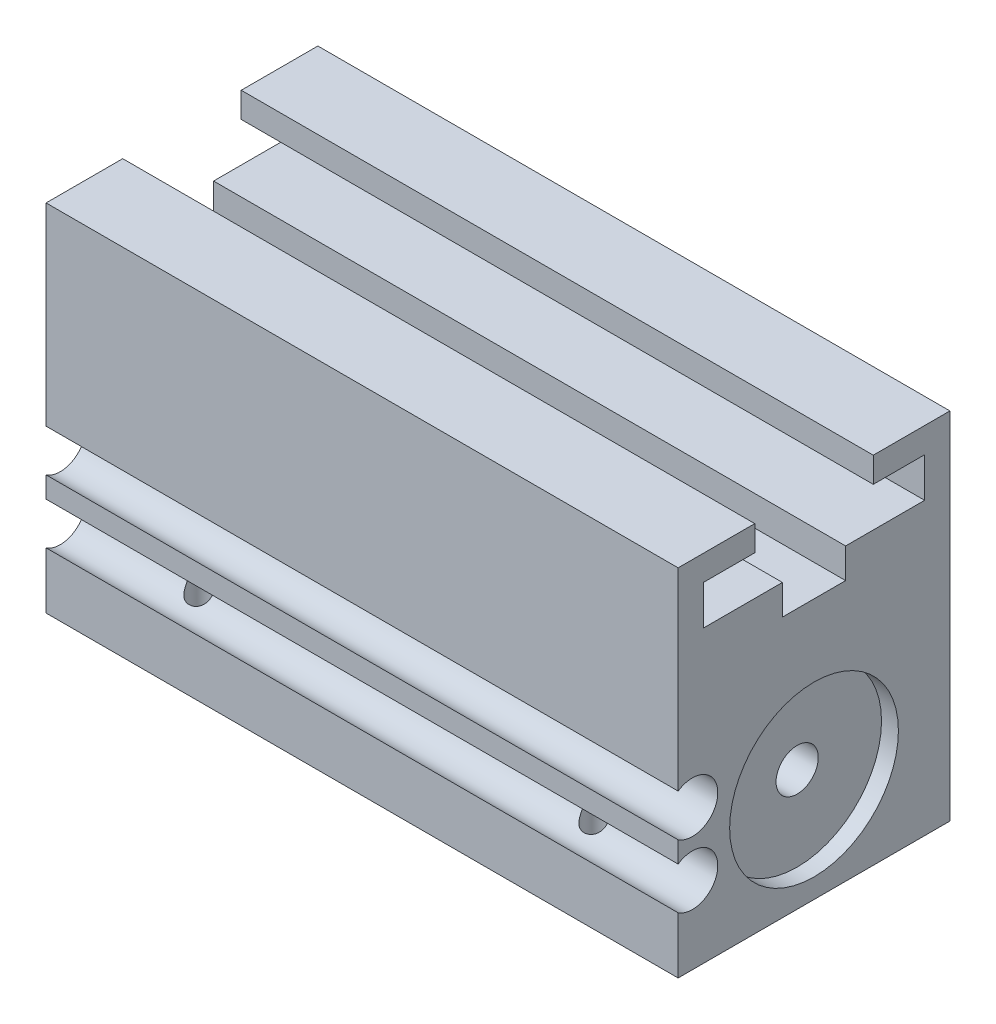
ISO-10303-21;
HEADER;
FILE_DESCRIPTION(('STEP AP214'),'2;1');
FILE_NAME('part.step','',(''),(''),'','','');
FILE_SCHEMA(('AUTOMOTIVE_DESIGN { 1 0 10303 214 1 1 1 1 }'));
ENDSEC;
DATA;
#1=APPLICATION_CONTEXT('core data for automotive mechanical design processes');
#2=APPLICATION_PROTOCOL_DEFINITION('international standard','automotive_design',2000,#1);
#3=PRODUCT_CONTEXT('',#1,'mechanical');
#4=PRODUCT('Part','Part','',(#3));
#5=PRODUCT_RELATED_PRODUCT_CATEGORY('part','',(#4));
#6=PRODUCT_DEFINITION_FORMATION('','',#4);
#7=PRODUCT_DEFINITION_CONTEXT('part definition',#1,'design');
#8=PRODUCT_DEFINITION('design','',#6,#7);
#9=PRODUCT_DEFINITION_SHAPE('','',#8);
#10=(LENGTH_UNIT() NAMED_UNIT(*) SI_UNIT(.MILLI.,.METRE.));
#11=(NAMED_UNIT(*) PLANE_ANGLE_UNIT() SI_UNIT($,.RADIAN.));
#12=(NAMED_UNIT(*) SI_UNIT($,.STERADIAN.) SOLID_ANGLE_UNIT());
#13=UNCERTAINTY_MEASURE_WITH_UNIT(LENGTH_MEASURE(1.E-05),#10,'distance_accuracy_value','');
#14=(GEOMETRIC_REPRESENTATION_CONTEXT(3) GLOBAL_UNCERTAINTY_ASSIGNED_CONTEXT((#13)) GLOBAL_UNIT_ASSIGNED_CONTEXT((#10,
#11,#12)) REPRESENTATION_CONTEXT('',''));
#15=CARTESIAN_POINT('',(0.,0.,0.));
#16=DIRECTION('',(0.,0.,1.));
#17=DIRECTION('',(1.,0.,0.));
#18=AXIS2_PLACEMENT_3D('',#15,#16,#17);
#19=CARTESIAN_POINT('',(49.44364,-5.9182,0.));
#20=DIRECTION('',(1.,0.,0.));
#21=DIRECTION('',(0.,0.,-1.));
#22=AXIS2_PLACEMENT_3D('',#19,#20,#21);
#23=PLANE('',#22);
#24=CARTESIAN_POINT('',(49.44364,-5.9182,0.));
#25=DIRECTION('',(1.,0.,0.));
#26=DIRECTION('',(0.,0.,-1.));
#27=AXIS2_PLACEMENT_3D('',#24,#25,#26);
#28=CIRCLE('',#27,6.7818);
#29=CARTESIAN_POINT('',(49.44364,-5.9182,-6.7818));
#30=VERTEX_POINT('',#29);
#31=EDGE_CURVE('E271',#30,#30,#28,.T.);
#32=ORIENTED_EDGE('',*,*,#31,.T.);
#33=EDGE_LOOP('',(#32));
#34=FACE_BOUND('',#33,.T.);
#35=CARTESIAN_POINT('',(49.44364,-5.9182,0.));
#36=DIRECTION('',(-1.,0.,0.));
#37=DIRECTION('',(0.,0.,1.));
#38=AXIS2_PLACEMENT_3D('',#35,#36,#37);
#39=CIRCLE('',#38,1.69545);
#40=CARTESIAN_POINT('',(49.44364,-5.9182,1.69545));
#41=VERTEX_POINT('',#40);
#42=EDGE_CURVE('E1202',#41,#41,#39,.T.);
#43=ORIENTED_EDGE('',*,*,#42,.T.);
#44=EDGE_LOOP('',(#43));
#45=FACE_BOUND('',#44,.T.);
#46=ADVANCED_FACE('F33',(#34,#45),#23,.T.);
#47=CARTESIAN_POINT('',(0.,-2.96037,9.77900000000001));
#48=DIRECTION('',(-1.,0.,0.));
#49=DIRECTION('',(0.,0.,1.));
#50=AXIS2_PLACEMENT_3D('',#47,#48,#49);
#51=PLANE('',#50);
#52=CARTESIAN_POINT('',(0.,4.3942,8.7249));
#53=DIRECTION('',(-1.,0.,0.));
#54=DIRECTION('',(0.,0.,1.));
#55=AXIS2_PLACEMENT_3D('',#52,#53,#54);
#56=CIRCLE('',#55,1.397);
#57=CARTESIAN_POINT('',(0.,4.3942,10.1219));
#58=VERTEX_POINT('',#57);
#59=EDGE_CURVE('E255',#58,#58,#56,.T.);
#60=ORIENTED_EDGE('',*,*,#59,.F.);
#61=EDGE_LOOP('',(#60));
#62=FACE_BOUND('',#61,.T.);
#63=CARTESIAN_POINT('',(0.,4.3942,-8.7249));
#64=DIRECTION('',(1.,0.,0.));
#65=DIRECTION('',(0.,0.,-1.));
#66=AXIS2_PLACEMENT_3D('',#63,#64,#65);
#67=CIRCLE('',#66,1.20269);
#68=CARTESIAN_POINT('',(0.,4.3942,-7.52221));
#69=VERTEX_POINT('',#68);
#70=EDGE_CURVE('E262',#69,#69,#67,.T.);
#71=ORIENTED_EDGE('',*,*,#70,.T.);
#72=EDGE_LOOP('',(#71));
#73=FACE_BOUND('',#72,.T.);
#74=DIRECTION('',(0.,-1.,0.));
#75=VECTOR('',#74,1.);
#76=CARTESIAN_POINT('',(0.,-9.7357605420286,10.922));
#77=LINE('',#76,#75);
#78=CARTESIAN_POINT('',(0.,-9.7357605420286,10.922));
#79=VERTEX_POINT('',#78);
#80=CARTESIAN_POINT('',(0.,-14.2748,10.922));
#81=VERTEX_POINT('',#80);
#82=EDGE_CURVE('E274',#79,#81,#77,.T.);
#83=ORIENTED_EDGE('',*,*,#82,.F.);
#84=CARTESIAN_POINT('',(0.,-8.04037,9.77900000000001));
#85=DIRECTION('',(-1.,0.,0.));
#86=DIRECTION('',(0.,0.,1.));
#87=AXIS2_PLACEMENT_3D('',#84,#85,#86);
#88=CIRCLE('',#87,2.0447);
#89=CARTESIAN_POINT('',(0.,-6.3449794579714,10.922));
#90=VERTEX_POINT('',#89);
#91=EDGE_CURVE('E281',#90,#79,#88,.T.);
#92=ORIENTED_EDGE('',*,*,#91,.F.);
#93=DIRECTION('',(0.,-1.,0.));
#94=VECTOR('',#93,1.);
#95=CARTESIAN_POINT('',(0.,-4.6557605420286,10.922));
#96=LINE('',#95,#94);
#97=CARTESIAN_POINT('',(0.,-4.6557605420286,10.922));
#98=VERTEX_POINT('',#97);
#99=EDGE_CURVE('E356',#98,#90,#96,.T.);
#100=ORIENTED_EDGE('',*,*,#99,.F.);
#101=CARTESIAN_POINT('',(0.,-2.96037,9.77900000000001));
#102=DIRECTION('',(-1.,0.,0.));
#103=DIRECTION('',(0.,0.,1.));
#104=AXIS2_PLACEMENT_3D('',#101,#102,#103);
#105=CIRCLE('',#104,2.0447);
#106=CARTESIAN_POINT('',(0.,-1.2649794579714,10.922));
#107=VERTEX_POINT('',#106);
#108=EDGE_CURVE('E354',#107,#98,#105,.T.);
#109=ORIENTED_EDGE('',*,*,#108,.F.);
#110=DIRECTION('',(0.,-1.,0.));
#111=VECTOR('',#110,1.);
#112=CARTESIAN_POINT('',(0.,14.2748,10.922));
#113=LINE('',#112,#111);
#114=CARTESIAN_POINT('',(0.,14.2748,10.922));
#115=VERTEX_POINT('',#114);
#116=EDGE_CURVE('E352',#115,#107,#113,.T.);
#117=ORIENTED_EDGE('',*,*,#116,.F.);
#118=DIRECTION('',(0.,0.,1.));
#119=VECTOR('',#118,1.);
#120=CARTESIAN_POINT('',(0.,14.2748,4.7625));
#121=LINE('',#120,#119);
#122=CARTESIAN_POINT('',(0.,14.2748,4.7625));
#123=VERTEX_POINT('',#122);
#124=EDGE_CURVE('E350',#123,#115,#121,.T.);
#125=ORIENTED_EDGE('',*,*,#124,.F.);
#126=DIRECTION('',(0.,1.,0.));
#127=VECTOR('',#126,1.);
#128=CARTESIAN_POINT('',(0.,12.2428,4.7625));
#129=LINE('',#128,#127);
#130=CARTESIAN_POINT('',(0.,12.2428,4.7625));
#131=VERTEX_POINT('',#130);
#132=EDGE_CURVE('E348',#131,#123,#129,.T.);
#133=ORIENTED_EDGE('',*,*,#132,.F.);
#134=DIRECTION('',(0.,0.,-1.));
#135=VECTOR('',#134,1.);
#136=CARTESIAN_POINT('',(0.,12.2428,8.89));
#137=LINE('',#136,#135);
#138=CARTESIAN_POINT('',(0.,12.2428,8.89));
#139=VERTEX_POINT('',#138);
#140=EDGE_CURVE('E346',#139,#131,#137,.T.);
#141=ORIENTED_EDGE('',*,*,#140,.F.);
#142=DIRECTION('',(0.,1.,0.));
#143=VECTOR('',#142,1.);
#144=CARTESIAN_POINT('',(0.,9.0678,8.89));
#145=LINE('',#144,#143);
#146=CARTESIAN_POINT('',(0.,9.0678,8.89));
#147=VERTEX_POINT('',#146);
#148=EDGE_CURVE('E344',#147,#139,#145,.T.);
#149=ORIENTED_EDGE('',*,*,#148,.F.);
#150=DIRECTION('',(0.,0.,1.));
#151=VECTOR('',#150,1.);
#152=CARTESIAN_POINT('',(0.,9.0678,2.54));
#153=LINE('',#152,#151);
#154=CARTESIAN_POINT('',(0.,9.0678,2.54));
#155=VERTEX_POINT('',#154);
#156=EDGE_CURVE('E342',#155,#147,#153,.T.);
#157=ORIENTED_EDGE('',*,*,#156,.F.);
#158=DIRECTION('',(0.,1.,0.));
#159=VECTOR('',#158,1.);
#160=CARTESIAN_POINT('',(0.,6.6548,2.54));
#161=LINE('',#160,#159);
#162=CARTESIAN_POINT('',(0.,6.6548,2.54));
#163=VERTEX_POINT('',#162);
#164=EDGE_CURVE('E340',#163,#155,#161,.T.);
#165=ORIENTED_EDGE('',*,*,#164,.F.);
#166=DIRECTION('',(0.,0.,1.));
#167=VECTOR('',#166,1.);
#168=CARTESIAN_POINT('',(0.,6.6548,-2.54));
#169=LINE('',#168,#167);
#170=CARTESIAN_POINT('',(0.,6.6548,-2.54));
#171=VERTEX_POINT('',#170);
#172=EDGE_CURVE('E338',#171,#163,#169,.T.);
#173=ORIENTED_EDGE('',*,*,#172,.F.);
#174=DIRECTION('',(0.,-1.,0.));
#175=VECTOR('',#174,1.);
#176=CARTESIAN_POINT('',(0.,9.0678,-2.54));
#177=LINE('',#176,#175);
#178=CARTESIAN_POINT('',(0.,9.0678,-2.54));
#179=VERTEX_POINT('',#178);
#180=EDGE_CURVE('E336',#179,#171,#177,.T.);
#181=ORIENTED_EDGE('',*,*,#180,.F.);
#182=DIRECTION('',(0.,0.,1.));
#183=VECTOR('',#182,1.);
#184=CARTESIAN_POINT('',(0.,9.0678,-8.89));
#185=LINE('',#184,#183);
#186=CARTESIAN_POINT('',(0.,9.0678,-8.89));
#187=VERTEX_POINT('',#186);
#188=EDGE_CURVE('E334',#187,#179,#185,.T.);
#189=ORIENTED_EDGE('',*,*,#188,.F.);
#190=DIRECTION('',(0.,-1.,0.));
#191=VECTOR('',#190,1.);
#192=CARTESIAN_POINT('',(0.,12.2428,-8.89));
#193=LINE('',#192,#191);
#194=CARTESIAN_POINT('',(0.,12.2428,-8.89));
#195=VERTEX_POINT('',#194);
#196=EDGE_CURVE('E332',#195,#187,#193,.T.);
#197=ORIENTED_EDGE('',*,*,#196,.F.);
#198=DIRECTION('',(0.,0.,-1.));
#199=VECTOR('',#198,1.);
#200=CARTESIAN_POINT('',(0.,12.2428,-4.7625));
#201=LINE('',#200,#199);
#202=CARTESIAN_POINT('',(0.,12.2428,-4.7625));
#203=VERTEX_POINT('',#202);
#204=EDGE_CURVE('E330',#203,#195,#201,.T.);
#205=ORIENTED_EDGE('',*,*,#204,.F.);
#206=DIRECTION('',(0.,-1.,0.));
#207=VECTOR('',#206,1.);
#208=CARTESIAN_POINT('',(0.,14.2748,-4.7625));
#209=LINE('',#208,#207);
#210=CARTESIAN_POINT('',(0.,14.2748,-4.7625));
#211=VERTEX_POINT('',#210);
#212=EDGE_CURVE('E328',#211,#203,#209,.T.);
#213=ORIENTED_EDGE('',*,*,#212,.F.);
#214=DIRECTION('',(0.,0.,1.));
#215=VECTOR('',#214,1.);
#216=CARTESIAN_POINT('',(0.,14.2748,-10.922));
#217=LINE('',#216,#215);
#218=CARTESIAN_POINT('',(0.,14.2748,-10.922));
#219=VERTEX_POINT('',#218);
#220=EDGE_CURVE('E326',#219,#211,#217,.T.);
#221=ORIENTED_EDGE('',*,*,#220,.F.);
#222=DIRECTION('',(0.,1.,0.));
#223=VECTOR('',#222,1.);
#224=CARTESIAN_POINT('',(0.,-14.2748,-10.922));
#225=LINE('',#224,#223);
#226=CARTESIAN_POINT('',(0.,-14.2748,-10.922));
#227=VERTEX_POINT('',#226);
#228=EDGE_CURVE('E324',#227,#219,#225,.T.);
#229=ORIENTED_EDGE('',*,*,#228,.F.);
#230=DIRECTION('',(0.,0.,-1.));
#231=VECTOR('',#230,1.);
#232=CARTESIAN_POINT('',(0.,-14.2748,10.922));
#233=LINE('',#232,#231);
#234=EDGE_CURVE('E322',#81,#227,#233,.T.);
#235=ORIENTED_EDGE('',*,*,#234,.F.);
#236=EDGE_LOOP('',(#83,#92,#100,#109,#117,#125,#133,#141,#149,#157,#165,#173,#181,#189,#197,
#205,#213,#221,#229,#235));
#237=FACE_BOUND('',#236,.T.);
#238=CARTESIAN_POINT('',(0.,-11.4808,8.7249));
#239=DIRECTION('',(1.,0.,0.));
#240=DIRECTION('',(0.,0.,-1.));
#241=AXIS2_PLACEMENT_3D('',#238,#239,#240);
#242=CIRCLE('',#241,1.20269);
#243=CARTESIAN_POINT('',(0.,-11.4808,9.92759));
#244=VERTEX_POINT('',#243);
#245=EDGE_CURVE('E258',#244,#244,#242,.T.);
#246=ORIENTED_EDGE('',*,*,#245,.T.);
#247=EDGE_LOOP('',(#246));
#248=FACE_BOUND('',#247,.T.);
#249=CARTESIAN_POINT('',(0.,-11.4808,-8.7249));
#250=DIRECTION('',(-1.,0.,0.));
#251=DIRECTION('',(0.,0.,1.));
#252=AXIS2_PLACEMENT_3D('',#249,#250,#251);
#253=CIRCLE('',#252,1.397);
#254=CARTESIAN_POINT('',(0.,-11.4808,-7.3279));
#255=VERTEX_POINT('',#254);
#256=EDGE_CURVE('E246',#255,#255,#253,.T.);
#257=ORIENTED_EDGE('',*,*,#256,.F.);
#258=EDGE_LOOP('',(#257));
#259=FACE_BOUND('',#258,.T.);
#260=CARTESIAN_POINT('',(0.,-5.9182,0.));
#261=DIRECTION('',(1.,0.,0.));
#262=DIRECTION('',(0.,0.,-1.));
#263=AXIS2_PLACEMENT_3D('',#260,#261,#262);
#264=CIRCLE('',#263,6.7818);
#265=CARTESIAN_POINT('',(0.,0.843348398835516,0.523712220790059));
#266=VERTEX_POINT('',#265);
#267=CARTESIAN_POINT('',(0.,0.843348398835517,-0.523712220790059));
#268=VERTEX_POINT('',#267);
#269=EDGE_CURVE('E208',#266,#268,#264,.T.);
#270=ORIENTED_EDGE('',*,*,#269,.T.);
#271=CARTESIAN_POINT('',(0.,2.8067,0.));
#272=DIRECTION('',(-1.,0.,0.));
#273=DIRECTION('',(0.,0.,1.));
#274=AXIS2_PLACEMENT_3D('',#271,#272,#273);
#275=CIRCLE('',#274,2.032);
#276=EDGE_CURVE('E52',#266,#268,#275,.T.);
#277=ORIENTED_EDGE('',*,*,#276,.F.);
#278=EDGE_LOOP('',(#270,#277));
#279=FACE_BOUND('',#278,.T.);
#280=ADVANCED_FACE('F207',(#62,#73,#237,#248,#259,#279),#51,.T.);
#281=CARTESIAN_POINT('',(1.35636,-5.9182,0.));
#282=DIRECTION('',(-1.,0.,0.));
#283=DIRECTION('',(0.,0.,1.));
#284=AXIS2_PLACEMENT_3D('',#281,#282,#283);
#285=CYLINDRICAL_SURFACE('',#284,6.7818);
#286=CARTESIAN_POINT('',(1.35636,-5.9182,0.));
#287=DIRECTION('',(1.,0.,0.));
#288=DIRECTION('',(0.,0.,-1.));
#289=AXIS2_PLACEMENT_3D('',#286,#287,#288);
#290=CIRCLE('',#289,6.7818);
#291=CARTESIAN_POINT('',(1.35636,-5.9182,-6.7818));
#292=VERTEX_POINT('',#291);
#293=EDGE_CURVE('E213',#292,#292,#290,.T.);
#294=ORIENTED_EDGE('',*,*,#293,.T.);
#295=EDGE_LOOP('',(#294));
#296=FACE_BOUND('',#295,.T.);
#297=ORIENTED_EDGE('',*,*,#269,.F.);
#298=CARTESIAN_POINT('',(-0.000200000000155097,0.843301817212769,0.524313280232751));
#299=CARTESIAN_POINT('',(0.0160462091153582,0.847084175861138,0.475592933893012));
#300=CARTESIAN_POINT('',(0.0304015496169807,0.850383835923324,0.426153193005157));
#301=CARTESIAN_POINT('',(0.0547683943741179,0.855940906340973,0.326077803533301));
#302=CARTESIAN_POINT('',(0.0647726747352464,0.858196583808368,0.27544031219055));
#303=CARTESIAN_POINT('',(0.0795718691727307,0.861520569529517,0.175043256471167));
#304=CARTESIAN_POINT('',(0.0845263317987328,0.86262526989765,0.125309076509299));
#305=CARTESIAN_POINT('',(0.0895037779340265,0.863734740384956,0.0256407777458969));
#306=CARTESIAN_POINT('',(0.0895317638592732,0.863740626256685,-0.0242930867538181));
#307=CARTESIAN_POINT('',(0.0833617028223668,0.862366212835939,-0.149793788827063));
#308=CARTESIAN_POINT('',(0.0739260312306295,0.860265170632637,-0.22521903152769));
#309=CARTESIAN_POINT('',(0.0519628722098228,0.855298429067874,-0.337640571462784));
#310=CARTESIAN_POINT('',(0.0431748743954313,0.85330248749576,-0.375474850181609));
#311=CARTESIAN_POINT('',(0.0232094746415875,0.848728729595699,-0.450433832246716));
#312=CARTESIAN_POINT('',(0.0120344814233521,0.846151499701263,-0.487559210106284));
#313=CARTESIAN_POINT('',(-0.000200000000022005,0.8433018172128,-0.524313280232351));
#314=B_SPLINE_CURVE_WITH_KNOTS('',3,(#298,#299,#300,#301,#302,#303,#304,#305,#306,#307,#308,
#309,#310,#311,#312,#313),.UNSPECIFIED.,.F.,.F.,(4,2,2,2,2,2,2,4),(0.,0.154522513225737,
0.309300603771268,0.459020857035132,0.608589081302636,0.835753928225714,0.952364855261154,
1.06885866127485),.UNSPECIFIED.);
#315=EDGE_CURVE('E11',#266,#268,#314,.T.);
#316=ORIENTED_EDGE('',*,*,#315,.T.);
#317=EDGE_LOOP('',(#297,#316));
#318=FACE_BOUND('',#317,.T.);
#319=ADVANCED_FACE('F212',(#296,#318),#285,.F.);
#320=CARTESIAN_POINT('',(50.8,-14.2748,10.922));
#321=DIRECTION('',(0.,1.,0.));
#322=DIRECTION('',(0.,0.,1.));
#323=AXIS2_PLACEMENT_3D('',#320,#321,#322);
#324=PLANE('',#323);
#325=CARTESIAN_POINT('',(15.875,-14.2748,7.9375));
#326=DIRECTION('',(0.,1.,0.));
#327=DIRECTION('',(0.,0.,1.));
#328=AXIS2_PLACEMENT_3D('',#325,#326,#327);
#329=CIRCLE('',#328,1.20269);
#330=CARTESIAN_POINT('',(15.875,-14.2748,9.14019));
#331=VERTEX_POINT('',#330);
#332=EDGE_CURVE('E667',#331,#331,#329,.T.);
#333=ORIENTED_EDGE('',*,*,#332,.T.);
#334=EDGE_LOOP('',(#333));
#335=FACE_BOUND('',#334,.T.);
#336=CARTESIAN_POINT('',(41.275,-14.2748,-7.9375));
#337=DIRECTION('',(0.,-1.,0.));
#338=DIRECTION('',(0.,0.,-1.));
#339=AXIS2_PLACEMENT_3D('',#336,#337,#338);
#340=CIRCLE('',#339,1.397);
#341=CARTESIAN_POINT('',(41.275,-14.2748,-9.3345));
#342=VERTEX_POINT('',#341);
#343=EDGE_CURVE('E688',#342,#342,#340,.T.);
#344=ORIENTED_EDGE('',*,*,#343,.F.);
#345=EDGE_LOOP('',(#344));
#346=FACE_BOUND('',#345,.T.);
#347=CARTESIAN_POINT('',(9.525,-14.2748,7.9375));
#348=DIRECTION('',(0.,-1.,0.));
#349=DIRECTION('',(0.,0.,-1.));
#350=AXIS2_PLACEMENT_3D('',#347,#348,#349);
#351=CIRCLE('',#350,1.397);
#352=CARTESIAN_POINT('',(9.525,-14.2748,6.5405));
#353=VERTEX_POINT('',#352);
#354=EDGE_CURVE('E214',#353,#353,#351,.T.);
#355=ORIENTED_EDGE('',*,*,#354,.F.);
#356=EDGE_LOOP('',(#355));
#357=FACE_BOUND('',#356,.T.);
#358=ORIENTED_EDGE('',*,*,#234,.T.);
#359=DIRECTION('',(-1.,0.,0.));
#360=VECTOR('',#359,1.);
#361=CARTESIAN_POINT('',(50.8,-14.2748,-10.922));
#362=LINE('',#361,#360);
#363=CARTESIAN_POINT('',(50.8,-14.2748,-10.922));
#364=VERTEX_POINT('',#363);
#365=EDGE_CURVE('E412',#364,#227,#362,.T.);
#366=ORIENTED_EDGE('',*,*,#365,.F.);
#367=DIRECTION('',(0.,0.,-1.));
#368=VECTOR('',#367,1.);
#369=CARTESIAN_POINT('',(50.8,-14.2748,10.922));
#370=LINE('',#369,#368);
#371=CARTESIAN_POINT('',(50.8,-14.2748,10.922));
#372=VERTEX_POINT('',#371);
#373=EDGE_CURVE('E280',#372,#364,#370,.T.);
#374=ORIENTED_EDGE('',*,*,#373,.F.);
#375=DIRECTION('',(-1.,0.,0.));
#376=VECTOR('',#375,1.);
#377=CARTESIAN_POINT('',(50.8,-14.2748,10.922));
#378=LINE('',#377,#376);
#379=EDGE_CURVE('E415',#372,#81,#378,.T.);
#380=ORIENTED_EDGE('',*,*,#379,.T.);
#381=EDGE_LOOP('',(#358,#366,#374,#380));
#382=FACE_BOUND('',#381,.T.);
#383=CARTESIAN_POINT('',(41.275,-14.2748,7.9375));
#384=DIRECTION('',(0.,-1.,0.));
#385=DIRECTION('',(0.,0.,-1.));
#386=AXIS2_PLACEMENT_3D('',#383,#384,#385);
#387=CIRCLE('',#386,1.397);
#388=CARTESIAN_POINT('',(41.275,-14.2748,6.5405));
#389=VERTEX_POINT('',#388);
#390=EDGE_CURVE('E656',#389,#389,#387,.T.);
#391=ORIENTED_EDGE('',*,*,#390,.F.);
#392=EDGE_LOOP('',(#391));
#393=FACE_BOUND('',#392,.T.);
#394=CARTESIAN_POINT('',(9.525,-14.2748,-7.9375));
#395=DIRECTION('',(0.,-1.,0.));
#396=DIRECTION('',(0.,0.,-1.));
#397=AXIS2_PLACEMENT_3D('',#394,#395,#396);
#398=CIRCLE('',#397,1.397);
#399=CARTESIAN_POINT('',(9.525,-14.2748,-9.3345));
#400=VERTEX_POINT('',#399);
#401=EDGE_CURVE('E660',#400,#400,#398,.T.);
#402=ORIENTED_EDGE('',*,*,#401,.F.);
#403=EDGE_LOOP('',(#402));
#404=FACE_BOUND('',#403,.T.);
#405=CARTESIAN_POINT('',(34.925,-14.2748,-7.9375));
#406=DIRECTION('',(0.,1.,0.));
#407=DIRECTION('',(0.,0.,1.));
#408=AXIS2_PLACEMENT_3D('',#405,#406,#407);
#409=CIRCLE('',#408,1.20269);
#410=CARTESIAN_POINT('',(34.925,-14.2748,-6.73481));
#411=VERTEX_POINT('',#410);
#412=EDGE_CURVE('E209',#411,#411,#409,.T.);
#413=ORIENTED_EDGE('',*,*,#412,.T.);
#414=EDGE_LOOP('',(#413));
#415=FACE_BOUND('',#414,.T.);
#416=ADVANCED_FACE('F459',(#335,#346,#357,#382,#393,#404,#415),#324,.F.);
#417=CARTESIAN_POINT('',(50.8,-8.04037,9.77900000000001));
#418=DIRECTION('',(-1.,0.,0.));
#419=DIRECTION('',(0.,0.,1.));
#420=AXIS2_PLACEMENT_3D('',#417,#418,#419);
#421=CYLINDRICAL_SURFACE('',#420,2.0447);
#422=CARTESIAN_POINT('',(8.50901420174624,-8.9177878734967,7.9321280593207));
#423=CARTESIAN_POINT('',(8.50892476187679,-8.95636474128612,7.95045035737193));
#424=CARTESIAN_POINT('',(8.50931028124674,-8.99437642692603,7.96999536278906));
#425=CARTESIAN_POINT('',(8.51147906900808,-9.06913097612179,8.01143843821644));
#426=CARTESIAN_POINT('',(8.51326459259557,-9.10587169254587,8.0333402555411));
#427=CARTESIAN_POINT('',(8.51870893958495,-9.17814584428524,8.07955298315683));
#428=CARTESIAN_POINT('',(8.52238458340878,-9.21366533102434,8.10388391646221));
#429=CARTESIAN_POINT('',(8.53211940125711,-9.28286430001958,8.15454750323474));
#430=CARTESIAN_POINT('',(8.53817689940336,-9.31654505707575,8.18087873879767));
#431=CARTESIAN_POINT('',(8.55705907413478,-9.39855684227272,8.24921579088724));
#432=CARTESIAN_POINT('',(8.57176056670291,-9.44556109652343,8.29234526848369));
#433=CARTESIAN_POINT('',(8.60953776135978,-9.53355722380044,8.38076382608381));
#434=CARTESIAN_POINT('',(8.63258356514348,-9.57456983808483,8.42604470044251));
#435=CARTESIAN_POINT('',(8.68869292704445,-9.65017399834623,8.51691561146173));
#436=CARTESIAN_POINT('',(8.72186390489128,-9.68468994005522,8.5625035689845));
#437=CARTESIAN_POINT('',(8.79851519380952,-9.74604771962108,8.65013760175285));
#438=CARTESIAN_POINT('',(8.84199407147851,-9.77289062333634,8.69218416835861));
#439=CARTESIAN_POINT('',(8.93110508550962,-9.81549649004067,8.76352093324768));
#440=CARTESIAN_POINT('',(8.97546734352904,-9.83231107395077,8.79377806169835));
#441=CARTESIAN_POINT('',(9.06968952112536,-9.86075633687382,8.8473799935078));
#442=CARTESIAN_POINT('',(9.11954776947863,-9.87238858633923,8.87072689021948));
#443=CARTESIAN_POINT('',(9.21958040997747,-9.8903258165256,8.90787469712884));
#444=CARTESIAN_POINT('',(9.26949825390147,-9.89694162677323,8.92222079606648));
#445=CARTESIAN_POINT('',(9.37127575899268,-9.90645650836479,8.94314552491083));
#446=CARTESIAN_POINT('',(9.42313522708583,-9.90935594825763,8.94972492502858));
#447=CARTESIAN_POINT('',(9.52728627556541,-9.91161451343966,8.9548336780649));
#448=CARTESIAN_POINT('',(9.57957751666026,-9.91097619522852,8.95336884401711));
#449=CARTESIAN_POINT('',(9.68315517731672,-9.90612507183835,8.94246484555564));
#450=CARTESIAN_POINT('',(9.73444158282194,-9.90191221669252,8.93302556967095));
#451=CARTESIAN_POINT('',(9.83463680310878,-9.88965400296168,8.90655622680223));
#452=CARTESIAN_POINT('',(9.88354134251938,-9.88160201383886,8.88951303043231));
#453=CARTESIAN_POINT('',(9.97746809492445,-9.86128203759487,8.84862617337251));
#454=CARTESIAN_POINT('',(10.022491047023,-9.84901485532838,8.82478381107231));
#455=CARTESIAN_POINT('',(10.1072454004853,-9.8199405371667,8.77160901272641));
#456=CARTESIAN_POINT('',(10.146999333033,-9.80315372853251,8.74230133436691));
#457=CARTESIAN_POINT('',(10.220552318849,-9.76478006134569,8.67965750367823));
#458=CARTESIAN_POINT('',(10.254351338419,-9.74319317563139,8.64632132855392));
#459=CARTESIAN_POINT('',(10.3162242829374,-9.6947139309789,8.57659366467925));
#460=CARTESIAN_POINT('',(10.344158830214,-9.66771707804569,8.54015174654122));
#461=CARTESIAN_POINT('',(10.3934586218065,-9.60904719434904,8.4666482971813));
#462=CARTESIAN_POINT('',(10.414823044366,-9.5773735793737,8.42958668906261));
#463=CARTESIAN_POINT('',(10.4585531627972,-9.49696183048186,8.34238987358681));
#464=CARTESIAN_POINT('',(10.4782025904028,-9.44631825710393,8.29265002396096));
#465=CARTESIAN_POINT('',(10.5084335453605,-9.33844902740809,8.19754472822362));
#466=CARTESIAN_POINT('',(10.5189818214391,-9.28120009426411,8.15219585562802));
#467=CARTESIAN_POINT('',(10.5321088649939,-9.17349169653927,8.07597652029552));
#468=CARTESIAN_POINT('',(10.5358498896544,-9.12392324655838,8.04401521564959));
#469=CARTESIAN_POINT('',(10.5403308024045,-9.02250284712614,7.98466002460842));
#470=CARTESIAN_POINT('',(10.5410938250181,-8.97067167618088,7.95723252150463));
#471=CARTESIAN_POINT('',(10.5409857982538,-8.9177878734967,7.9321280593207));
#472=B_SPLINE_CURVE_WITH_KNOTS('',3,(#422,#423,#424,#425,#426,#427,#428,#429,#430,#431,#432,
#433,#434,#435,#436,#437,#438,#439,#440,#441,#442,#443,#444,#445,#446,#447,#448,#449,#450,#451,
#452,#453,#454,#455,#456,#457,#458,#459,#460,#461,#462,#463,#464,#465,#466,#467,#468,#469,#470,
#471),.UNSPECIFIED.,.F.,.F.,(4,2,2,2,2,2,2,2,2,2,2,2,2,2,2,2,2,2,2,2,2,2,2,2,4),(0.,
0.128116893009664,0.256440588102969,0.385926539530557,0.515321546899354,0.710957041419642,
0.905898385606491,1.10298435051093,1.30004292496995,1.46795211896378,1.63581039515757,
1.79214820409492,1.94847050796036,2.1046798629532,2.26089140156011,2.4173737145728,
2.57382616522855,2.72958638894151,2.88534749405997,3.04447187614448,3.20361615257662,
3.4233576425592,3.64389860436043,3.82089850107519,3.99652060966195),.UNSPECIFIED.);
#473=CARTESIAN_POINT('',(8.50901420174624,-8.9177878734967,7.9321280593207));
#474=VERTEX_POINT('',#473);
#475=CARTESIAN_POINT('',(10.5409857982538,-8.91778787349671,7.9321280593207));
#476=VERTEX_POINT('',#475);
#477=EDGE_CURVE('E425',#474,#476,#472,.T.);
#478=ORIENTED_EDGE('',*,*,#477,.F.);
#479=CARTESIAN_POINT('',(10.6426939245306,-8.97664666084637,7.96125851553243));
#480=CARTESIAN_POINT('',(10.5925362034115,-8.94752036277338,7.94625721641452));
#481=CARTESIAN_POINT('',(10.5421211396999,-8.91838866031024,7.93213690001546));
#482=CARTESIAN_POINT('',(10.4408016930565,-8.86019246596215,7.90557710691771));
#483=CARTESIAN_POINT('',(10.3898972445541,-8.83112798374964,7.89313785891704));
#484=CARTESIAN_POINT('',(10.2880172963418,-8.77336722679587,7.86994943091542));
#485=CARTESIAN_POINT('',(10.237045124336,-8.74466981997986,7.85918839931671));
#486=CARTESIAN_POINT('',(10.134635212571,-8.68758524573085,7.83920030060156));
#487=CARTESIAN_POINT('',(10.0831975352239,-8.65919803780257,7.82997303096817));
#488=CARTESIAN_POINT('',(10.0073090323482,-8.61809331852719,7.81756662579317));
#489=CARTESIAN_POINT('',(9.98310557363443,-8.60509803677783,7.81378771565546));
#490=CARTESIAN_POINT('',(9.9345130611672,-8.57935059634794,7.80657090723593));
#491=CARTESIAN_POINT('',(9.91012397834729,-8.56659847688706,7.80313306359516));
#492=CARTESIAN_POINT('',(9.86094648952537,-8.5414157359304,7.79659710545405));
#493=CARTESIAN_POINT('',(9.83615656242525,-8.52898751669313,7.79350116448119));
#494=CARTESIAN_POINT('',(9.78618659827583,-8.50484461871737,7.78771524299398));
#495=CARTESIAN_POINT('',(9.76100670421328,-8.49312968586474,7.78502511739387));
#496=CARTESIAN_POINT('',(9.71083227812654,-8.47142596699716,7.7802236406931));
#497=CARTESIAN_POINT('',(9.68585830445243,-8.46139346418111,7.77809632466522));
#498=CARTESIAN_POINT('',(9.63506429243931,-8.44412314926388,7.77454028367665));
#499=CARTESIAN_POINT('',(9.60925527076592,-8.43685828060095,7.77310475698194));
#500=CARTESIAN_POINT('',(9.57292935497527,-8.4305922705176,7.77188065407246));
#501=CARTESIAN_POINT('',(9.56284673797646,-8.42925998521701,7.77162274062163));
#502=CARTESIAN_POINT('',(9.54260206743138,-8.42752629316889,7.77128765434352));
#503=CARTESIAN_POINT('',(9.53244006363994,-8.42712434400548,7.77121037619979));
#504=CARTESIAN_POINT('',(9.51209317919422,-8.42729709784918,7.77124366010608));
#505=CARTESIAN_POINT('',(9.50190832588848,-8.42787484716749,7.77135480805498));
#506=CARTESIAN_POINT('',(9.48163626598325,-8.42994526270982,7.77175554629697));
#507=CARTESIAN_POINT('',(9.47154908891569,-8.43143819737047,7.77204518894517));
#508=CARTESIAN_POINT('',(9.44004332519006,-8.43733908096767,7.77320090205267));
#509=CARTESIAN_POINT('',(9.41889971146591,-8.44312637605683,7.77434706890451));
#510=CARTESIAN_POINT('',(9.37728630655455,-8.45668709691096,7.7771193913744));
#511=CARTESIAN_POINT('',(9.35681874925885,-8.46446648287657,7.77874698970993));
#512=CARTESIAN_POINT('',(9.31592017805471,-8.48127103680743,7.78238277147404));
#513=CARTESIAN_POINT('',(9.29549956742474,-8.49031954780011,7.78439843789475));
#514=CARTESIAN_POINT('',(9.25501950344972,-8.50903639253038,7.78871296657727));
#515=CARTESIAN_POINT('',(9.23495954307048,-8.51870375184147,7.79101138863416));
#516=CARTESIAN_POINT('',(9.17816821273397,-8.54675210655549,7.79790818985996));
#517=CARTESIAN_POINT('',(9.14169645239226,-8.56558292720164,7.8028067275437));
#518=CARTESIAN_POINT('',(9.06916390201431,-8.60381723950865,7.81336483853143));
#519=CARTESIAN_POINT('',(9.0331031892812,-8.62322083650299,7.81902455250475));
#520=CARTESIAN_POINT('',(8.92527148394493,-8.68191899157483,7.83712286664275));
#521=CARTESIAN_POINT('',(8.85392705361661,-8.72166136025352,7.8506711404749));
#522=CARTESIAN_POINT('',(8.71963242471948,-8.79726996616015,7.87916783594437));
#523=CARTESIAN_POINT('',(8.65659654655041,-8.83309885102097,7.89381404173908));
#524=CARTESIAN_POINT('',(8.53134883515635,-8.90483748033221,7.92561768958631));
#525=CARTESIAN_POINT('',(8.46913584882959,-8.94074700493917,7.9427710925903));
#526=CARTESIAN_POINT('',(8.4073060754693,-8.97664666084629,7.96125851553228));
#527=B_SPLINE_CURVE_WITH_KNOTS('',3,(#479,#480,#481,#482,#483,#484,#485,#486,#487,#488,#489,
#490,#491,#492,#493,#494,#495,#496,#497,#498,#499,#500,#501,#502,#503,#504,#505,#506,#507,#508,
#509,#510,#511,#512,#513,#514,#515,#516,#517,#518,#519,#520,#521,#522,#523,#524,#525,#526),
.UNSPECIFIED.,.F.,.F.,(4,2,2,2,2,2,2,2,2,2,2,2,2,2,2,2,2,2,2,2,2,2,2,4),(0.,0.17971862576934,
0.359461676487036,0.537871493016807,0.716257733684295,0.799445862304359,0.882647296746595,
0.966350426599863,1.05002355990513,1.13097810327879,1.21111957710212,1.24160016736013,
1.27206298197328,1.30262069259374,1.33318737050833,1.39881744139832,1.46464621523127,
1.53190150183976,1.59905337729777,1.72304056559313,1.84705069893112,2.09532971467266,
2.31719992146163,2.53871656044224),.UNSPECIFIED.);
#528=EDGE_CURVE('E418',#476,#474,#527,.T.);
#529=ORIENTED_EDGE('',*,*,#528,.F.);
#530=EDGE_LOOP('',(#478,#529));
#531=FACE_BOUND('',#530,.T.);
#532=ORIENTED_EDGE('',*,*,#91,.T.);
#533=DIRECTION('',(-1.,0.,0.));
#534=VECTOR('',#533,1.);
#535=CARTESIAN_POINT('',(50.8,-9.7357605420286,10.922));
#536=LINE('',#535,#534);
#537=CARTESIAN_POINT('',(50.8,-9.7357605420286,10.922));
#538=VERTEX_POINT('',#537);
#539=EDGE_CURVE('E319',#538,#79,#536,.T.);
#540=ORIENTED_EDGE('',*,*,#539,.F.);
#541=CARTESIAN_POINT('',(50.8,-8.04037,9.77900000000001));
#542=DIRECTION('',(-1.,0.,0.));
#543=DIRECTION('',(0.,0.,1.));
#544=AXIS2_PLACEMENT_3D('',#541,#542,#543);
#545=CIRCLE('',#544,2.0447);
#546=CARTESIAN_POINT('',(50.8,-6.3449794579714,10.922));
#547=VERTEX_POINT('',#546);
#548=EDGE_CURVE('E317',#547,#538,#545,.T.);
#549=ORIENTED_EDGE('',*,*,#548,.F.);
#550=DIRECTION('',(-1.,0.,0.));
#551=VECTOR('',#550,1.);
#552=CARTESIAN_POINT('',(50.8,-6.3449794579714,10.922));
#553=LINE('',#552,#551);
#554=EDGE_CURVE('E361',#547,#90,#553,.T.);
#555=ORIENTED_EDGE('',*,*,#554,.T.);
#556=EDGE_LOOP('',(#532,#540,#549,#555));
#557=FACE_BOUND('',#556,.T.);
#558=CARTESIAN_POINT('',(40.2590142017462,-8.9177878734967,7.9321280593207));
#559=CARTESIAN_POINT('',(40.2589247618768,-8.95636474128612,7.95045035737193));
#560=CARTESIAN_POINT('',(40.2593102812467,-8.99437642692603,7.96999536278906));
#561=CARTESIAN_POINT('',(40.2614790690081,-9.06913097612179,8.01143843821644));
#562=CARTESIAN_POINT('',(40.2632645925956,-9.10587169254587,8.0333402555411));
#563=CARTESIAN_POINT('',(40.2687089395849,-9.17814584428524,8.07955298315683));
#564=CARTESIAN_POINT('',(40.2723845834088,-9.21366533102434,8.10388391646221));
#565=CARTESIAN_POINT('',(40.2821194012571,-9.28286430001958,8.15454750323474));
#566=CARTESIAN_POINT('',(40.2881768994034,-9.31654505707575,8.18087873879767));
#567=CARTESIAN_POINT('',(40.3070590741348,-9.39855684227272,8.24921579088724));
#568=CARTESIAN_POINT('',(40.3217605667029,-9.44556109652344,8.29234526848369));
#569=CARTESIAN_POINT('',(40.3595377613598,-9.53355722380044,8.38076382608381));
#570=CARTESIAN_POINT('',(40.3825835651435,-9.57456983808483,8.42604470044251));
#571=CARTESIAN_POINT('',(40.4386929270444,-9.65017399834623,8.51691561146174));
#572=CARTESIAN_POINT('',(40.4718639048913,-9.68468994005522,8.5625035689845));
#573=CARTESIAN_POINT('',(40.5485151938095,-9.74604771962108,8.65013760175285));
#574=CARTESIAN_POINT('',(40.5919940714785,-9.77289062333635,8.69218416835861));
#575=CARTESIAN_POINT('',(40.6811050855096,-9.81549649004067,8.76352093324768));
#576=CARTESIAN_POINT('',(40.725467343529,-9.83231107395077,8.79377806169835));
#577=CARTESIAN_POINT('',(40.8196895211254,-9.86075633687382,8.8473799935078));
#578=CARTESIAN_POINT('',(40.8695477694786,-9.87238858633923,8.87072689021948));
#579=CARTESIAN_POINT('',(40.9695804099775,-9.8903258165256,8.90787469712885));
#580=CARTESIAN_POINT('',(41.0194982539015,-9.89694162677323,8.92222079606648));
#581=CARTESIAN_POINT('',(41.1212757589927,-9.90645650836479,8.94314552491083));
#582=CARTESIAN_POINT('',(41.1731352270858,-9.90935594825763,8.94972492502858));
#583=CARTESIAN_POINT('',(41.2772862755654,-9.91161451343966,8.9548336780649));
#584=CARTESIAN_POINT('',(41.3295775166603,-9.91097619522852,8.95336884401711));
#585=CARTESIAN_POINT('',(41.4331551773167,-9.90612507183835,8.94246484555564));
#586=CARTESIAN_POINT('',(41.4844415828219,-9.90191221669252,8.93302556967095));
#587=CARTESIAN_POINT('',(41.5846368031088,-9.88965400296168,8.90655622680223));
#588=CARTESIAN_POINT('',(41.6335413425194,-9.88160201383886,8.88951303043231));
#589=CARTESIAN_POINT('',(41.7274680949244,-9.86128203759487,8.84862617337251));
#590=CARTESIAN_POINT('',(41.772491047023,-9.84901485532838,8.82478381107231));
#591=CARTESIAN_POINT('',(41.8572454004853,-9.8199405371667,8.77160901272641));
#592=CARTESIAN_POINT('',(41.896999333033,-9.80315372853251,8.74230133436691));
#593=CARTESIAN_POINT('',(41.970552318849,-9.76478006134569,8.67965750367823));
#594=CARTESIAN_POINT('',(42.004351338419,-9.74319317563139,8.64632132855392));
#595=CARTESIAN_POINT('',(42.0662242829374,-9.6947139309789,8.57659366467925));
#596=CARTESIAN_POINT('',(42.094158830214,-9.66771707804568,8.54015174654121));
#597=CARTESIAN_POINT('',(42.1434586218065,-9.60904719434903,8.4666482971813));
#598=CARTESIAN_POINT('',(42.164823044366,-9.57737357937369,8.4295866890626));
#599=CARTESIAN_POINT('',(42.2085531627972,-9.49696183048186,8.34238987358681));
#600=CARTESIAN_POINT('',(42.2282025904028,-9.44631825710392,8.29265002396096));
#601=CARTESIAN_POINT('',(42.2584335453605,-9.33844902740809,8.19754472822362));
#602=CARTESIAN_POINT('',(42.2689818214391,-9.28120009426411,8.15219585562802));
#603=CARTESIAN_POINT('',(42.2821088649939,-9.17349169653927,8.07597652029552));
#604=CARTESIAN_POINT('',(42.2858498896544,-9.12392324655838,8.04401521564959));
#605=CARTESIAN_POINT('',(42.2903308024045,-9.02250284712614,7.98466002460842));
#606=CARTESIAN_POINT('',(42.2910938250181,-8.97067167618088,7.95723252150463));
#607=CARTESIAN_POINT('',(42.2909857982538,-8.9177878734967,7.9321280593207));
#608=B_SPLINE_CURVE_WITH_KNOTS('',3,(#558,#559,#560,#561,#562,#563,#564,#565,#566,#567,#568,
#569,#570,#571,#572,#573,#574,#575,#576,#577,#578,#579,#580,#581,#582,#583,#584,#585,#586,#587,
#588,#589,#590,#591,#592,#593,#594,#595,#596,#597,#598,#599,#600,#601,#602,#603,#604,#605,#606,
#607),.UNSPECIFIED.,.F.,.F.,(4,2,2,2,2,2,2,2,2,2,2,2,2,2,2,2,2,2,2,2,2,2,2,2,4),(0.,
0.128116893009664,0.256440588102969,0.385926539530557,0.515321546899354,0.710957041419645,
0.905898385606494,1.10298435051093,1.30004292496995,1.46795211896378,1.63581039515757,
1.79214820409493,1.94847050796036,2.10467986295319,2.26089140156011,2.41737371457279,
2.57382616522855,2.72958638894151,2.88534749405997,3.04447187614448,3.20361615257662,
3.42335764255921,3.64389860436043,3.82089850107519,3.99652060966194),.UNSPECIFIED.);
#609=CARTESIAN_POINT('',(40.2590142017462,-8.9177878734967,7.9321280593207));
#610=VERTEX_POINT('',#609);
#611=CARTESIAN_POINT('',(42.2909857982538,-8.91778787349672,7.9321280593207));
#612=VERTEX_POINT('',#611);
#613=EDGE_CURVE('E46',#610,#612,#608,.T.);
#614=ORIENTED_EDGE('',*,*,#613,.F.);
#615=CARTESIAN_POINT('',(42.3926939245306,-8.97664666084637,7.96125851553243));
#616=CARTESIAN_POINT('',(42.3425362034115,-8.94752036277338,7.94625721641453));
#617=CARTESIAN_POINT('',(42.2921211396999,-8.91838866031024,7.93213690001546));
#618=CARTESIAN_POINT('',(42.1908016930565,-8.86019246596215,7.90557710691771));
#619=CARTESIAN_POINT('',(42.1398972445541,-8.83112798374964,7.89313785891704));
#620=CARTESIAN_POINT('',(42.0380172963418,-8.77336722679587,7.86994943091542));
#621=CARTESIAN_POINT('',(41.987045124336,-8.74466981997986,7.85918839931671));
#622=CARTESIAN_POINT('',(41.884635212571,-8.68758524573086,7.83920030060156));
#623=CARTESIAN_POINT('',(41.8331975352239,-8.65919803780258,7.82997303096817));
#624=CARTESIAN_POINT('',(41.7573090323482,-8.61809331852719,7.81756662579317));
#625=CARTESIAN_POINT('',(41.7331055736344,-8.60509803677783,7.81378771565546));
#626=CARTESIAN_POINT('',(41.6845130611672,-8.57935059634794,7.80657090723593));
#627=CARTESIAN_POINT('',(41.6601239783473,-8.56659847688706,7.80313306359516));
#628=CARTESIAN_POINT('',(41.6109464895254,-8.5414157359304,7.79659710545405));
#629=CARTESIAN_POINT('',(41.5861565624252,-8.52898751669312,7.79350116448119));
#630=CARTESIAN_POINT('',(41.5361865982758,-8.50484461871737,7.78771524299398));
#631=CARTESIAN_POINT('',(41.5110067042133,-8.49312968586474,7.78502511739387));
#632=CARTESIAN_POINT('',(41.4608322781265,-8.47142596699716,7.7802236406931));
#633=CARTESIAN_POINT('',(41.4358583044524,-8.46139346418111,7.77809632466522));
#634=CARTESIAN_POINT('',(41.3850642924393,-8.44412314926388,7.77454028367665));
#635=CARTESIAN_POINT('',(41.3592552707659,-8.43685828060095,7.77310475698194));
#636=CARTESIAN_POINT('',(41.3229293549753,-8.4305922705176,7.77188065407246));
#637=CARTESIAN_POINT('',(41.3128467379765,-8.42925998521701,7.77162274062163));
#638=CARTESIAN_POINT('',(41.2926020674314,-8.42752629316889,7.77128765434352));
#639=CARTESIAN_POINT('',(41.2824400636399,-8.42712434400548,7.77121037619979));
#640=CARTESIAN_POINT('',(41.2620931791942,-8.42729709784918,7.77124366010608));
#641=CARTESIAN_POINT('',(41.2519083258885,-8.42787484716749,7.77135480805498));
#642=CARTESIAN_POINT('',(41.2316362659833,-8.42994526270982,7.77175554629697));
#643=CARTESIAN_POINT('',(41.2215490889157,-8.43143819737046,7.77204518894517));
#644=CARTESIAN_POINT('',(41.1900433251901,-8.43733908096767,7.77320090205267));
#645=CARTESIAN_POINT('',(41.1688997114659,-8.44312637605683,7.77434706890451));
#646=CARTESIAN_POINT('',(41.1272863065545,-8.45668709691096,7.7771193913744));
#647=CARTESIAN_POINT('',(41.1068187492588,-8.46446648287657,7.77874698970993));
#648=CARTESIAN_POINT('',(41.0659201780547,-8.48127103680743,7.78238277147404));
#649=CARTESIAN_POINT('',(41.0454995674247,-8.49031954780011,7.78439843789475));
#650=CARTESIAN_POINT('',(41.0050195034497,-8.50903639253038,7.78871296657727));
#651=CARTESIAN_POINT('',(40.9849595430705,-8.51870375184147,7.79101138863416));
#652=CARTESIAN_POINT('',(40.928168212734,-8.54675210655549,7.79790818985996));
#653=CARTESIAN_POINT('',(40.8916964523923,-8.56558292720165,7.8028067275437));
#654=CARTESIAN_POINT('',(40.8191639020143,-8.60381723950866,7.81336483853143));
#655=CARTESIAN_POINT('',(40.7831031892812,-8.62322083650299,7.81902455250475));
#656=CARTESIAN_POINT('',(40.6752714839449,-8.68191899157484,7.83712286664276));
#657=CARTESIAN_POINT('',(40.6039270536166,-8.72166136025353,7.8506711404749));
#658=CARTESIAN_POINT('',(40.4696324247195,-8.79726996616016,7.87916783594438));
#659=CARTESIAN_POINT('',(40.4065965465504,-8.83309885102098,7.89381404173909));
#660=CARTESIAN_POINT('',(40.2813488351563,-8.90483748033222,7.92561768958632));
#661=CARTESIAN_POINT('',(40.2191358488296,-8.94074700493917,7.9427710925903));
#662=CARTESIAN_POINT('',(40.1573060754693,-8.97664666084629,7.96125851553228));
#663=B_SPLINE_CURVE_WITH_KNOTS('',3,(#615,#616,#617,#618,#619,#620,#621,#622,#623,#624,#625,
#626,#627,#628,#629,#630,#631,#632,#633,#634,#635,#636,#637,#638,#639,#640,#641,#642,#643,#644,
#645,#646,#647,#648,#649,#650,#651,#652,#653,#654,#655,#656,#657,#658,#659,#660,#661,#662),
.UNSPECIFIED.,.F.,.F.,(4,2,2,2,2,2,2,2,2,2,2,2,2,2,2,2,2,2,2,2,2,2,2,4),(0.,0.179718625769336,
0.359461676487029,0.5378714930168,0.716257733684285,0.799445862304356,0.882647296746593,
0.96635042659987,1.05002355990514,1.1309781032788,1.21111957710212,1.24160016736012,
1.27206298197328,1.30262069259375,1.33318737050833,1.39881744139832,1.46464621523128,
1.53190150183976,1.59905337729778,1.72304056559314,1.84705069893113,2.09532971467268,
2.31719992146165,2.53871656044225),.UNSPECIFIED.);
#664=EDGE_CURVE('E707',#612,#610,#663,.T.);
#665=ORIENTED_EDGE('',*,*,#664,.F.);
#666=EDGE_LOOP('',(#614,#665));
#667=FACE_BOUND('',#666,.T.);
#668=ADVANCED_FACE('F431',(#531,#557,#667),#421,.F.);
#669=CARTESIAN_POINT('',(50.8,-14.2748,-10.922));
#670=DIRECTION('',(0.,0.,1.));
#671=DIRECTION('',(1.,0.,0.));
#672=AXIS2_PLACEMENT_3D('',#669,#670,#671);
#673=PLANE('',#672);
#674=CARTESIAN_POINT('',(7.62,1.5748,-10.922));
#675=DIRECTION('',(0.,0.,1.));
#676=DIRECTION('',(1.,0.,0.));
#677=AXIS2_PLACEMENT_3D('',#674,#675,#676);
#678=CIRCLE('',#677,2.413);
#679=CARTESIAN_POINT('',(10.033,1.5748,-10.922));
#680=VERTEX_POINT('',#679);
#681=EDGE_CURVE('E231',#680,#680,#678,.T.);
#682=ORIENTED_EDGE('',*,*,#681,.T.);
#683=EDGE_LOOP('',(#682));
#684=FACE_BOUND('',#683,.T.);
#685=ORIENTED_EDGE('',*,*,#228,.T.);
#686=DIRECTION('',(-1.,0.,0.));
#687=VECTOR('',#686,1.);
#688=CARTESIAN_POINT('',(50.8,14.2748,-10.922));
#689=LINE('',#688,#687);
#690=CARTESIAN_POINT('',(50.8,14.2748,-10.922));
#691=VERTEX_POINT('',#690);
#692=EDGE_CURVE('E409',#691,#219,#689,.T.);
#693=ORIENTED_EDGE('',*,*,#692,.F.);
#694=DIRECTION('',(0.,1.,0.));
#695=VECTOR('',#694,1.);
#696=CARTESIAN_POINT('',(50.8,-14.2748,-10.922));
#697=LINE('',#696,#695);
#698=EDGE_CURVE('E283',#364,#691,#697,.T.);
#699=ORIENTED_EDGE('',*,*,#698,.F.);
#700=ORIENTED_EDGE('',*,*,#365,.T.);
#701=EDGE_LOOP('',(#685,#693,#699,#700));
#702=FACE_BOUND('',#701,.T.);
#703=CARTESIAN_POINT('',(43.434,1.5748,-10.922));
#704=DIRECTION('',(0.,0.,1.));
#705=DIRECTION('',(1.,0.,0.));
#706=AXIS2_PLACEMENT_3D('',#703,#704,#705);
#707=CIRCLE('',#706,2.413);
#708=CARTESIAN_POINT('',(45.847,1.5748,-10.922));
#709=VERTEX_POINT('',#708);
#710=EDGE_CURVE('E217',#709,#709,#707,.T.);
#711=ORIENTED_EDGE('',*,*,#710,.T.);
#712=EDGE_LOOP('',(#711));
#713=FACE_BOUND('',#712,.T.);
#714=ADVANCED_FACE('F644',(#684,#702,#713),#673,.F.);
#715=CARTESIAN_POINT('',(50.8,-9.7357605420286,10.922));
#716=DIRECTION('',(0.,0.,-1.));
#717=DIRECTION('',(-1.,0.,0.));
#718=AXIS2_PLACEMENT_3D('',#715,#716,#717);
#719=PLANE('',#718);
#720=ORIENTED_EDGE('',*,*,#82,.T.);
#721=ORIENTED_EDGE('',*,*,#379,.F.);
#722=DIRECTION('',(0.,-1.,0.));
#723=VECTOR('',#722,1.);
#724=CARTESIAN_POINT('',(50.8,-9.7357605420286,10.922));
#725=LINE('',#724,#723);
#726=EDGE_CURVE('E277',#538,#372,#725,.T.);
#727=ORIENTED_EDGE('',*,*,#726,.F.);
#728=ORIENTED_EDGE('',*,*,#539,.T.);
#729=EDGE_LOOP('',(#720,#721,#727,#728));
#730=FACE_BOUND('',#729,.T.);
#731=ADVANCED_FACE('F35',(#730),#719,.F.);
#732=CARTESIAN_POINT('',(50.8,14.2748,-10.922));
#733=DIRECTION('',(0.,-1.,0.));
#734=DIRECTION('',(0.,0.,-1.));
#735=AXIS2_PLACEMENT_3D('',#732,#733,#734);
#736=PLANE('',#735);
#737=ORIENTED_EDGE('',*,*,#220,.T.);
#738=DIRECTION('',(-1.,0.,0.));
#739=VECTOR('',#738,1.);
#740=CARTESIAN_POINT('',(50.8,14.2748,-4.7625));
#741=LINE('',#740,#739);
#742=CARTESIAN_POINT('',(50.8,14.2748,-4.7625));
#743=VERTEX_POINT('',#742);
#744=EDGE_CURVE('E406',#743,#211,#741,.T.);
#745=ORIENTED_EDGE('',*,*,#744,.F.);
#746=DIRECTION('',(0.,0.,1.));
#747=VECTOR('',#746,1.);
#748=CARTESIAN_POINT('',(50.8,14.2748,-10.922));
#749=LINE('',#748,#747);
#750=EDGE_CURVE('E285',#691,#743,#749,.T.);
#751=ORIENTED_EDGE('',*,*,#750,.F.);
#752=ORIENTED_EDGE('',*,*,#692,.T.);
#753=EDGE_LOOP('',(#737,#745,#751,#752));
#754=FACE_BOUND('',#753,.T.);
#755=ADVANCED_FACE('F641',(#754),#736,.F.);
#756=CARTESIAN_POINT('',(50.8,14.2748,-4.7625));
#757=DIRECTION('',(0.,0.,-1.));
#758=DIRECTION('',(-1.,0.,0.));
#759=AXIS2_PLACEMENT_3D('',#756,#757,#758);
#760=PLANE('',#759);
#761=ORIENTED_EDGE('',*,*,#212,.T.);
#762=DIRECTION('',(-1.,0.,0.));
#763=VECTOR('',#762,1.);
#764=CARTESIAN_POINT('',(50.8,12.2428,-4.7625));
#765=LINE('',#764,#763);
#766=CARTESIAN_POINT('',(50.8,12.2428,-4.7625));
#767=VERTEX_POINT('',#766);
#768=EDGE_CURVE('E403',#767,#203,#765,.T.);
#769=ORIENTED_EDGE('',*,*,#768,.F.);
#770=DIRECTION('',(0.,-1.,0.));
#771=VECTOR('',#770,1.);
#772=CARTESIAN_POINT('',(50.8,14.2748,-4.7625));
#773=LINE('',#772,#771);
#774=EDGE_CURVE('E287',#743,#767,#773,.T.);
#775=ORIENTED_EDGE('',*,*,#774,.F.);
#776=ORIENTED_EDGE('',*,*,#744,.T.);
#777=EDGE_LOOP('',(#761,#769,#775,#776));
#778=FACE_BOUND('',#777,.T.);
#779=ADVANCED_FACE('F637',(#778),#760,.F.);
#780=CARTESIAN_POINT('',(50.8,12.2428,-4.7625));
#781=DIRECTION('',(0.,1.,0.));
#782=DIRECTION('',(0.,0.,1.));
#783=AXIS2_PLACEMENT_3D('',#780,#781,#782);
#784=PLANE('',#783);
#785=ORIENTED_EDGE('',*,*,#204,.T.);
#786=DIRECTION('',(-1.,0.,0.));
#787=VECTOR('',#786,1.);
#788=CARTESIAN_POINT('',(50.8,12.2428,-8.89));
#789=LINE('',#788,#787);
#790=CARTESIAN_POINT('',(50.8,12.2428,-8.89));
#791=VERTEX_POINT('',#790);
#792=EDGE_CURVE('E400',#791,#195,#789,.T.);
#793=ORIENTED_EDGE('',*,*,#792,.F.);
#794=DIRECTION('',(0.,0.,-1.));
#795=VECTOR('',#794,1.);
#796=CARTESIAN_POINT('',(50.8,12.2428,-4.7625));
#797=LINE('',#796,#795);
#798=EDGE_CURVE('E289',#767,#791,#797,.T.);
#799=ORIENTED_EDGE('',*,*,#798,.F.);
#800=ORIENTED_EDGE('',*,*,#768,.T.);
#801=EDGE_LOOP('',(#785,#793,#799,#800));
#802=FACE_BOUND('',#801,.T.);
#803=ADVANCED_FACE('F632',(#802),#784,.F.);
#804=CARTESIAN_POINT('',(50.8,12.2428,-8.89));
#805=DIRECTION('',(0.,0.,-1.));
#806=DIRECTION('',(-1.,0.,0.));
#807=AXIS2_PLACEMENT_3D('',#804,#805,#806);
#808=PLANE('',#807);
#809=ORIENTED_EDGE('',*,*,#196,.T.);
#810=DIRECTION('',(-1.,0.,0.));
#811=VECTOR('',#810,1.);
#812=CARTESIAN_POINT('',(50.8,9.0678,-8.89));
#813=LINE('',#812,#811);
#814=CARTESIAN_POINT('',(50.8,9.0678,-8.89));
#815=VERTEX_POINT('',#814);
#816=EDGE_CURVE('E397',#815,#187,#813,.T.);
#817=ORIENTED_EDGE('',*,*,#816,.F.);
#818=DIRECTION('',(0.,-1.,0.));
#819=VECTOR('',#818,1.);
#820=CARTESIAN_POINT('',(50.8,12.2428,-8.89));
#821=LINE('',#820,#819);
#822=EDGE_CURVE('E291',#791,#815,#821,.T.);
#823=ORIENTED_EDGE('',*,*,#822,.F.);
#824=ORIENTED_EDGE('',*,*,#792,.T.);
#825=EDGE_LOOP('',(#809,#817,#823,#824));
#826=FACE_BOUND('',#825,.T.);
#827=ADVANCED_FACE('F626',(#826),#808,.F.);
#828=CARTESIAN_POINT('',(50.8,9.0678,-8.89));
#829=DIRECTION('',(0.,-1.,0.));
#830=DIRECTION('',(0.,0.,-1.));
#831=AXIS2_PLACEMENT_3D('',#828,#829,#830);
#832=PLANE('',#831);
#833=ORIENTED_EDGE('',*,*,#188,.T.);
#834=DIRECTION('',(-1.,0.,0.));
#835=VECTOR('',#834,1.);
#836=CARTESIAN_POINT('',(50.8,9.0678,-2.54));
#837=LINE('',#836,#835);
#838=CARTESIAN_POINT('',(50.8,9.0678,-2.54));
#839=VERTEX_POINT('',#838);
#840=EDGE_CURVE('E394',#839,#179,#837,.T.);
#841=ORIENTED_EDGE('',*,*,#840,.F.);
#842=DIRECTION('',(0.,0.,1.));
#843=VECTOR('',#842,1.);
#844=CARTESIAN_POINT('',(50.8,9.0678,-8.89));
#845=LINE('',#844,#843);
#846=EDGE_CURVE('E293',#815,#839,#845,.T.);
#847=ORIENTED_EDGE('',*,*,#846,.F.);
#848=ORIENTED_EDGE('',*,*,#816,.T.);
#849=EDGE_LOOP('',(#833,#841,#847,#848));
#850=FACE_BOUND('',#849,.T.);
#851=ADVANCED_FACE('F622',(#850),#832,.F.);
#852=CARTESIAN_POINT('',(50.8,9.0678,-2.54));
#853=DIRECTION('',(0.,0.,-1.));
#854=DIRECTION('',(-1.,0.,0.));
#855=AXIS2_PLACEMENT_3D('',#852,#853,#854);
#856=PLANE('',#855);
#857=ORIENTED_EDGE('',*,*,#180,.T.);
#858=DIRECTION('',(-1.,0.,0.));
#859=VECTOR('',#858,1.);
#860=CARTESIAN_POINT('',(50.8,6.6548,-2.54));
#861=LINE('',#860,#859);
#862=CARTESIAN_POINT('',(50.8,6.6548,-2.54));
#863=VERTEX_POINT('',#862);
#864=EDGE_CURVE('E391',#863,#171,#861,.T.);
#865=ORIENTED_EDGE('',*,*,#864,.F.);
#866=DIRECTION('',(0.,-1.,0.));
#867=VECTOR('',#866,1.);
#868=CARTESIAN_POINT('',(50.8,9.0678,-2.54));
#869=LINE('',#868,#867);
#870=EDGE_CURVE('E295',#839,#863,#869,.T.);
#871=ORIENTED_EDGE('',*,*,#870,.F.);
#872=ORIENTED_EDGE('',*,*,#840,.T.);
#873=EDGE_LOOP('',(#857,#865,#871,#872));
#874=FACE_BOUND('',#873,.T.);
#875=ADVANCED_FACE('F617',(#874),#856,.F.);
#876=CARTESIAN_POINT('',(50.8,6.6548,-2.54));
#877=DIRECTION('',(0.,-1.,0.));
#878=DIRECTION('',(0.,0.,-1.));
#879=AXIS2_PLACEMENT_3D('',#876,#877,#878);
#880=PLANE('',#879);
#881=ORIENTED_EDGE('',*,*,#172,.T.);
#882=DIRECTION('',(-1.,0.,0.));
#883=VECTOR('',#882,1.);
#884=CARTESIAN_POINT('',(50.8,6.6548,2.54));
#885=LINE('',#884,#883);
#886=CARTESIAN_POINT('',(50.8,6.6548,2.54));
#887=VERTEX_POINT('',#886);
#888=EDGE_CURVE('E388',#887,#163,#885,.T.);
#889=ORIENTED_EDGE('',*,*,#888,.F.);
#890=DIRECTION('',(0.,0.,1.));
#891=VECTOR('',#890,1.);
#892=CARTESIAN_POINT('',(50.8,6.6548,-2.54));
#893=LINE('',#892,#891);
#894=EDGE_CURVE('E297',#863,#887,#893,.T.);
#895=ORIENTED_EDGE('',*,*,#894,.F.);
#896=ORIENTED_EDGE('',*,*,#864,.T.);
#897=EDGE_LOOP('',(#881,#889,#895,#896));
#898=FACE_BOUND('',#897,.T.);
#899=ADVANCED_FACE('F611',(#898),#880,.F.);
#900=CARTESIAN_POINT('',(50.8,6.6548,2.54));
#901=DIRECTION('',(0.,0.,1.));
#902=DIRECTION('',(1.,0.,0.));
#903=AXIS2_PLACEMENT_3D('',#900,#901,#902);
#904=PLANE('',#903);
#905=ORIENTED_EDGE('',*,*,#164,.T.);
#906=DIRECTION('',(-1.,0.,0.));
#907=VECTOR('',#906,1.);
#908=CARTESIAN_POINT('',(50.8,9.0678,2.54));
#909=LINE('',#908,#907);
#910=CARTESIAN_POINT('',(50.8,9.0678,2.54));
#911=VERTEX_POINT('',#910);
#912=EDGE_CURVE('E385',#911,#155,#909,.T.);
#913=ORIENTED_EDGE('',*,*,#912,.F.);
#914=DIRECTION('',(0.,1.,0.));
#915=VECTOR('',#914,1.);
#916=CARTESIAN_POINT('',(50.8,6.6548,2.54));
#917=LINE('',#916,#915);
#918=EDGE_CURVE('E299',#887,#911,#917,.T.);
#919=ORIENTED_EDGE('',*,*,#918,.F.);
#920=ORIENTED_EDGE('',*,*,#888,.T.);
#921=EDGE_LOOP('',(#905,#913,#919,#920));
#922=FACE_BOUND('',#921,.T.);
#923=ADVANCED_FACE('F607',(#922),#904,.F.);
#924=CARTESIAN_POINT('',(50.8,9.0678,2.54));
#925=DIRECTION('',(0.,-1.,0.));
#926=DIRECTION('',(0.,0.,-1.));
#927=AXIS2_PLACEMENT_3D('',#924,#925,#926);
#928=PLANE('',#927);
#929=ORIENTED_EDGE('',*,*,#156,.T.);
#930=DIRECTION('',(-1.,0.,0.));
#931=VECTOR('',#930,1.);
#932=CARTESIAN_POINT('',(50.8,9.0678,8.89));
#933=LINE('',#932,#931);
#934=CARTESIAN_POINT('',(50.8,9.0678,8.89));
#935=VERTEX_POINT('',#934);
#936=EDGE_CURVE('E382',#935,#147,#933,.T.);
#937=ORIENTED_EDGE('',*,*,#936,.F.);
#938=DIRECTION('',(0.,0.,1.));
#939=VECTOR('',#938,1.);
#940=CARTESIAN_POINT('',(50.8,9.0678,2.54));
#941=LINE('',#940,#939);
#942=EDGE_CURVE('E301',#911,#935,#941,.T.);
#943=ORIENTED_EDGE('',*,*,#942,.F.);
#944=ORIENTED_EDGE('',*,*,#912,.T.);
#945=EDGE_LOOP('',(#929,#937,#943,#944));
#946=FACE_BOUND('',#945,.T.);
#947=ADVANCED_FACE('F602',(#946),#928,.F.);
#948=CARTESIAN_POINT('',(50.8,9.0678,8.89));
#949=DIRECTION('',(0.,0.,1.));
#950=DIRECTION('',(1.,0.,0.));
#951=AXIS2_PLACEMENT_3D('',#948,#949,#950);
#952=PLANE('',#951);
#953=ORIENTED_EDGE('',*,*,#148,.T.);
#954=DIRECTION('',(-1.,0.,0.));
#955=VECTOR('',#954,1.);
#956=CARTESIAN_POINT('',(50.8,12.2428,8.89));
#957=LINE('',#956,#955);
#958=CARTESIAN_POINT('',(50.8,12.2428,8.89));
#959=VERTEX_POINT('',#958);
#960=EDGE_CURVE('E379',#959,#139,#957,.T.);
#961=ORIENTED_EDGE('',*,*,#960,.F.);
#962=DIRECTION('',(0.,1.,0.));
#963=VECTOR('',#962,1.);
#964=CARTESIAN_POINT('',(50.8,9.0678,8.89));
#965=LINE('',#964,#963);
#966=EDGE_CURVE('E303',#935,#959,#965,.T.);
#967=ORIENTED_EDGE('',*,*,#966,.F.);
#968=ORIENTED_EDGE('',*,*,#936,.T.);
#969=EDGE_LOOP('',(#953,#961,#967,#968));
#970=FACE_BOUND('',#969,.T.);
#971=ADVANCED_FACE('F596',(#970),#952,.F.);
#972=CARTESIAN_POINT('',(50.8,12.2428,8.89));
#973=DIRECTION('',(0.,1.,0.));
#974=DIRECTION('',(0.,0.,1.));
#975=AXIS2_PLACEMENT_3D('',#972,#973,#974);
#976=PLANE('',#975);
#977=ORIENTED_EDGE('',*,*,#140,.T.);
#978=DIRECTION('',(-1.,0.,0.));
#979=VECTOR('',#978,1.);
#980=CARTESIAN_POINT('',(50.8,12.2428,4.7625));
#981=LINE('',#980,#979);
#982=CARTESIAN_POINT('',(50.8,12.2428,4.7625));
#983=VERTEX_POINT('',#982);
#984=EDGE_CURVE('E376',#983,#131,#981,.T.);
#985=ORIENTED_EDGE('',*,*,#984,.F.);
#986=DIRECTION('',(0.,0.,-1.));
#987=VECTOR('',#986,1.);
#988=CARTESIAN_POINT('',(50.8,12.2428,8.89));
#989=LINE('',#988,#987);
#990=EDGE_CURVE('E305',#959,#983,#989,.T.);
#991=ORIENTED_EDGE('',*,*,#990,.F.);
#992=ORIENTED_EDGE('',*,*,#960,.T.);
#993=EDGE_LOOP('',(#977,#985,#991,#992));
#994=FACE_BOUND('',#993,.T.);
#995=ADVANCED_FACE('F592',(#994),#976,.F.);
#996=CARTESIAN_POINT('',(50.8,12.2428,4.7625));
#997=DIRECTION('',(0.,0.,1.));
#998=DIRECTION('',(1.,0.,0.));
#999=AXIS2_PLACEMENT_3D('',#996,#997,#998);
#1000=PLANE('',#999);
#1001=ORIENTED_EDGE('',*,*,#132,.T.);
#1002=DIRECTION('',(-1.,0.,0.));
#1003=VECTOR('',#1002,1.);
#1004=CARTESIAN_POINT('',(50.8,14.2748,4.7625));
#1005=LINE('',#1004,#1003);
#1006=CARTESIAN_POINT('',(50.8,14.2748,4.7625));
#1007=VERTEX_POINT('',#1006);
#1008=EDGE_CURVE('E373',#1007,#123,#1005,.T.);
#1009=ORIENTED_EDGE('',*,*,#1008,.F.);
#1010=DIRECTION('',(0.,1.,0.));
#1011=VECTOR('',#1010,1.);
#1012=CARTESIAN_POINT('',(50.8,12.2428,4.7625));
#1013=LINE('',#1012,#1011);
#1014=EDGE_CURVE('E307',#983,#1007,#1013,.T.);
#1015=ORIENTED_EDGE('',*,*,#1014,.F.);
#1016=ORIENTED_EDGE('',*,*,#984,.T.);
#1017=EDGE_LOOP('',(#1001,#1009,#1015,#1016));
#1018=FACE_BOUND('',#1017,.T.);
#1019=ADVANCED_FACE('F587',(#1018),#1000,.F.);
#1020=CARTESIAN_POINT('',(50.8,14.2748,4.7625));
#1021=DIRECTION('',(0.,-1.,0.));
#1022=DIRECTION('',(0.,0.,-1.));
#1023=AXIS2_PLACEMENT_3D('',#1020,#1021,#1022);
#1024=PLANE('',#1023);
#1025=ORIENTED_EDGE('',*,*,#124,.T.);
#1026=DIRECTION('',(-1.,0.,0.));
#1027=VECTOR('',#1026,1.);
#1028=CARTESIAN_POINT('',(50.8,14.2748,10.922));
#1029=LINE('',#1028,#1027);
#1030=CARTESIAN_POINT('',(50.8,14.2748,10.922));
#1031=VERTEX_POINT('',#1030);
#1032=EDGE_CURVE('E370',#1031,#115,#1029,.T.);
#1033=ORIENTED_EDGE('',*,*,#1032,.F.);
#1034=DIRECTION('',(0.,0.,1.));
#1035=VECTOR('',#1034,1.);
#1036=CARTESIAN_POINT('',(50.8,14.2748,4.7625));
#1037=LINE('',#1036,#1035);
#1038=EDGE_CURVE('E309',#1007,#1031,#1037,.T.);
#1039=ORIENTED_EDGE('',*,*,#1038,.F.);
#1040=ORIENTED_EDGE('',*,*,#1008,.T.);
#1041=EDGE_LOOP('',(#1025,#1033,#1039,#1040));
#1042=FACE_BOUND('',#1041,.T.);
#1043=ADVANCED_FACE('F581',(#1042),#1024,.F.);
#1044=CARTESIAN_POINT('',(50.8,14.2748,10.922));
#1045=DIRECTION('',(0.,0.,-1.));
#1046=DIRECTION('',(-1.,0.,0.));
#1047=AXIS2_PLACEMENT_3D('',#1044,#1045,#1046);
#1048=PLANE('',#1047);
#1049=ORIENTED_EDGE('',*,*,#116,.T.);
#1050=DIRECTION('',(-1.,0.,0.));
#1051=VECTOR('',#1050,1.);
#1052=CARTESIAN_POINT('',(50.8,-1.2649794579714,10.922));
#1053=LINE('',#1052,#1051);
#1054=CARTESIAN_POINT('',(50.8,-1.2649794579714,10.922));
#1055=VERTEX_POINT('',#1054);
#1056=EDGE_CURVE('E367',#1055,#107,#1053,.T.);
#1057=ORIENTED_EDGE('',*,*,#1056,.F.);
#1058=DIRECTION('',(0.,-1.,0.));
#1059=VECTOR('',#1058,1.);
#1060=CARTESIAN_POINT('',(50.8,14.2748,10.922));
#1061=LINE('',#1060,#1059);
#1062=EDGE_CURVE('E311',#1031,#1055,#1061,.T.);
#1063=ORIENTED_EDGE('',*,*,#1062,.F.);
#1064=ORIENTED_EDGE('',*,*,#1032,.T.);
#1065=EDGE_LOOP('',(#1049,#1057,#1063,#1064));
#1066=FACE_BOUND('',#1065,.T.);
#1067=ADVANCED_FACE('F577',(#1066),#1048,.F.);
#1068=CARTESIAN_POINT('',(50.8,-2.96037,9.77900000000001));
#1069=DIRECTION('',(-1.,0.,0.));
#1070=DIRECTION('',(0.,0.,1.));
#1071=AXIS2_PLACEMENT_3D('',#1068,#1069,#1070);
#1072=CYLINDRICAL_SURFACE('',#1071,2.0447);
#1073=ORIENTED_EDGE('',*,*,#108,.T.);
#1074=DIRECTION('',(-1.,0.,0.));
#1075=VECTOR('',#1074,1.);
#1076=CARTESIAN_POINT('',(50.8,-4.6557605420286,10.922));
#1077=LINE('',#1076,#1075);
#1078=CARTESIAN_POINT('',(50.8,-4.6557605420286,10.922));
#1079=VERTEX_POINT('',#1078);
#1080=EDGE_CURVE('E364',#1079,#98,#1077,.T.);
#1081=ORIENTED_EDGE('',*,*,#1080,.F.);
#1082=CARTESIAN_POINT('',(50.8,-2.96037,9.77900000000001));
#1083=DIRECTION('',(-1.,0.,0.));
#1084=DIRECTION('',(0.,0.,1.));
#1085=AXIS2_PLACEMENT_3D('',#1082,#1083,#1084);
#1086=CIRCLE('',#1085,2.0447);
#1087=EDGE_CURVE('E313',#1055,#1079,#1086,.T.);
#1088=ORIENTED_EDGE('',*,*,#1087,.F.);
#1089=ORIENTED_EDGE('',*,*,#1056,.T.);
#1090=EDGE_LOOP('',(#1073,#1081,#1088,#1089));
#1091=FACE_BOUND('',#1090,.T.);
#1092=ADVANCED_FACE('F572',(#1091),#1072,.F.);
#1093=CARTESIAN_POINT('',(50.8,-4.6557605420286,10.922));
#1094=DIRECTION('',(0.,0.,-1.));
#1095=DIRECTION('',(-1.,0.,0.));
#1096=AXIS2_PLACEMENT_3D('',#1093,#1094,#1095);
#1097=PLANE('',#1096);
#1098=ORIENTED_EDGE('',*,*,#99,.T.);
#1099=ORIENTED_EDGE('',*,*,#554,.F.);
#1100=DIRECTION('',(0.,-1.,0.));
#1101=VECTOR('',#1100,1.);
#1102=CARTESIAN_POINT('',(50.8,-4.6557605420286,10.922));
#1103=LINE('',#1102,#1101);
#1104=EDGE_CURVE('E315',#1079,#547,#1103,.T.);
#1105=ORIENTED_EDGE('',*,*,#1104,.F.);
#1106=ORIENTED_EDGE('',*,*,#1080,.T.);
#1107=EDGE_LOOP('',(#1098,#1099,#1105,#1106));
#1108=FACE_BOUND('',#1107,.T.);
#1109=ADVANCED_FACE('F533',(#1108),#1097,.F.);
#1110=CARTESIAN_POINT('',(50.8,-2.96037,9.77900000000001));
#1111=DIRECTION('',(-1.,0.,0.));
#1112=DIRECTION('',(0.,0.,1.));
#1113=AXIS2_PLACEMENT_3D('',#1110,#1111,#1112);
#1114=PLANE('',#1113);
#1115=CARTESIAN_POINT('',(50.8,-5.9182,0.));
#1116=DIRECTION('',(1.,0.,0.));
#1117=DIRECTION('',(0.,0.,-1.));
#1118=AXIS2_PLACEMENT_3D('',#1115,#1116,#1117);
#1119=CIRCLE('',#1118,6.7818);
#1120=CARTESIAN_POINT('',(50.8,-5.9182,-6.7818));
#1121=VERTEX_POINT('',#1120);
#1122=EDGE_CURVE('E268',#1121,#1121,#1119,.T.);
#1123=ORIENTED_EDGE('',*,*,#1122,.F.);
#1124=EDGE_LOOP('',(#1123));
#1125=FACE_BOUND('',#1124,.T.);
#1126=ORIENTED_EDGE('',*,*,#726,.T.);
#1127=ORIENTED_EDGE('',*,*,#373,.T.);
#1128=ORIENTED_EDGE('',*,*,#698,.T.);
#1129=ORIENTED_EDGE('',*,*,#750,.T.);
#1130=ORIENTED_EDGE('',*,*,#774,.T.);
#1131=ORIENTED_EDGE('',*,*,#798,.T.);
#1132=ORIENTED_EDGE('',*,*,#822,.T.);
#1133=ORIENTED_EDGE('',*,*,#846,.T.);
#1134=ORIENTED_EDGE('',*,*,#870,.T.);
#1135=ORIENTED_EDGE('',*,*,#894,.T.);
#1136=ORIENTED_EDGE('',*,*,#918,.T.);
#1137=ORIENTED_EDGE('',*,*,#942,.T.);
#1138=ORIENTED_EDGE('',*,*,#966,.T.);
#1139=ORIENTED_EDGE('',*,*,#990,.T.);
#1140=ORIENTED_EDGE('',*,*,#1014,.T.);
#1141=ORIENTED_EDGE('',*,*,#1038,.T.);
#1142=ORIENTED_EDGE('',*,*,#1062,.T.);
#1143=ORIENTED_EDGE('',*,*,#1087,.T.);
#1144=ORIENTED_EDGE('',*,*,#1104,.T.);
#1145=ORIENTED_EDGE('',*,*,#548,.T.);
#1146=EDGE_LOOP('',(#1126,#1127,#1128,#1129,#1130,#1131,#1132,#1133,#1134,#1135,#1136,#1137,
#1138,#1139,#1140,#1141,#1142,#1143,#1144,#1145));
#1147=FACE_BOUND('',#1146,.T.);
#1148=ADVANCED_FACE('F530',(#1125,#1147),#1114,.F.);
#1149=CARTESIAN_POINT('',(49.44364,-5.9182,0.));
#1150=DIRECTION('',(1.,0.,0.));
#1151=DIRECTION('',(0.,0.,-1.));
#1152=AXIS2_PLACEMENT_3D('',#1149,#1150,#1151);
#1153=CYLINDRICAL_SURFACE('',#1152,6.7818);
#1154=CARTESIAN_POINT('',(49.44364,-5.9182,-6.7818));
#1155=CARTESIAN_POINT('',(49.45776875,-5.9182,-6.7818));
#1156=CARTESIAN_POINT('',(49.4718975,-5.9182,-6.7818));
#1157=CARTESIAN_POINT('',(49.500155,-5.9182,-6.7818));
#1158=CARTESIAN_POINT('',(49.51428375,-5.9182,-6.7818));
#1159=CARTESIAN_POINT('',(49.54254125,-5.9182,-6.7818));
#1160=CARTESIAN_POINT('',(49.55667,-5.9182,-6.7818));
#1161=CARTESIAN_POINT('',(49.5849275,-5.9182,-6.7818));
#1162=CARTESIAN_POINT('',(49.59905625,-5.9182,-6.7818));
#1163=CARTESIAN_POINT('',(49.62731375,-5.9182,-6.7818));
#1164=CARTESIAN_POINT('',(49.6414425,-5.9182,-6.7818));
#1165=CARTESIAN_POINT('',(49.6697,-5.9182,-6.7818));
#1166=CARTESIAN_POINT('',(49.68382875,-5.9182,-6.7818));
#1167=CARTESIAN_POINT('',(49.71208625,-5.9182,-6.7818));
#1168=CARTESIAN_POINT('',(49.726215,-5.9182,-6.7818));
#1169=CARTESIAN_POINT('',(49.7544725,-5.9182,-6.7818));
#1170=CARTESIAN_POINT('',(49.76860125,-5.9182,-6.7818));
#1171=CARTESIAN_POINT('',(49.79685875,-5.9182,-6.7818));
#1172=CARTESIAN_POINT('',(49.8109875,-5.9182,-6.7818));
#1173=CARTESIAN_POINT('',(49.839245,-5.9182,-6.7818));
#1174=CARTESIAN_POINT('',(49.85337375,-5.9182,-6.7818));
#1175=CARTESIAN_POINT('',(49.88163125,-5.9182,-6.7818));
#1176=CARTESIAN_POINT('',(49.89576,-5.9182,-6.7818));
#1177=CARTESIAN_POINT('',(49.9240175,-5.9182,-6.7818));
#1178=CARTESIAN_POINT('',(49.93814625,-5.9182,-6.7818));
#1179=CARTESIAN_POINT('',(49.96640375,-5.9182,-6.7818));
#1180=CARTESIAN_POINT('',(49.9805325,-5.9182,-6.7818));
#1181=CARTESIAN_POINT('',(50.00879,-5.9182,-6.7818));
#1182=CARTESIAN_POINT('',(50.02291875,-5.9182,-6.7818));
#1183=CARTESIAN_POINT('',(50.05117625,-5.9182,-6.7818));
#1184=CARTESIAN_POINT('',(50.065305,-5.9182,-6.7818));
#1185=CARTESIAN_POINT('',(50.0935625,-5.9182,-6.7818));
#1186=CARTESIAN_POINT('',(50.10769125,-5.9182,-6.7818));
#1187=CARTESIAN_POINT('',(50.13594875,-5.9182,-6.7818));
#1188=CARTESIAN_POINT('',(50.1500775,-5.9182,-6.7818));
#1189=CARTESIAN_POINT('',(50.178335,-5.9182,-6.7818));
#1190=CARTESIAN_POINT('',(50.19246375,-5.9182,-6.7818));
#1191=CARTESIAN_POINT('',(50.22072125,-5.9182,-6.7818));
#1192=CARTESIAN_POINT('',(50.23485,-5.9182,-6.7818));
#1193=CARTESIAN_POINT('',(50.2631075,-5.9182,-6.7818));
#1194=CARTESIAN_POINT('',(50.27723625,-5.9182,-6.7818));
#1195=CARTESIAN_POINT('',(50.30549375,-5.9182,-6.7818));
#1196=CARTESIAN_POINT('',(50.3196225,-5.9182,-6.7818));
#1197=CARTESIAN_POINT('',(50.34788,-5.9182,-6.7818));
#1198=CARTESIAN_POINT('',(50.36200875,-5.9182,-6.7818));
#1199=CARTESIAN_POINT('',(50.39026625,-5.9182,-6.7818));
#1200=CARTESIAN_POINT('',(50.404395,-5.9182,-6.7818));
#1201=CARTESIAN_POINT('',(50.4326525,-5.9182,-6.7818));
#1202=CARTESIAN_POINT('',(50.44678125,-5.9182,-6.7818));
#1203=CARTESIAN_POINT('',(50.47503875,-5.9182,-6.7818));
#1204=CARTESIAN_POINT('',(50.4891675,-5.9182,-6.7818));
#1205=CARTESIAN_POINT('',(50.517425,-5.9182,-6.7818));
#1206=CARTESIAN_POINT('',(50.53155375,-5.9182,-6.7818));
#1207=CARTESIAN_POINT('',(50.55981125,-5.9182,-6.7818));
#1208=CARTESIAN_POINT('',(50.57394,-5.9182,-6.7818));
#1209=CARTESIAN_POINT('',(50.6021975,-5.9182,-6.7818));
#1210=CARTESIAN_POINT('',(50.61632625,-5.9182,-6.7818));
#1211=CARTESIAN_POINT('',(50.64458375,-5.9182,-6.7818));
#1212=CARTESIAN_POINT('',(50.6587125,-5.9182,-6.7818));
#1213=CARTESIAN_POINT('',(50.68697,-5.9182,-6.7818));
#1214=CARTESIAN_POINT('',(50.70109875,-5.9182,-6.7818));
#1215=CARTESIAN_POINT('',(50.72935625,-5.9182,-6.7818));
#1216=CARTESIAN_POINT('',(50.743485,-5.9182,-6.7818));
#1217=CARTESIAN_POINT('',(50.7717425,-5.9182,-6.7818));
#1218=CARTESIAN_POINT('',(50.78587125,-5.9182,-6.7818));
#1219=CARTESIAN_POINT('',(50.8,-5.9182,-6.7818));
#1220=B_SPLINE_CURVE_WITH_KNOTS('',3,(#1154,#1155,#1156,#1157,#1158,#1159,#1160,#1161,#1162,
#1163,#1164,#1165,#1166,#1167,#1168,#1169,#1170,#1171,#1172,#1173,#1174,#1175,#1176,#1177,#1178,
#1179,#1180,#1181,#1182,#1183,#1184,#1185,#1186,#1187,#1188,#1189,#1190,#1191,#1192,#1193,#1194,
#1195,#1196,#1197,#1198,#1199,#1200,#1201,#1202,#1203,#1204,#1205,#1206,#1207,#1208,#1209,#1210,
#1211,#1212,#1213,#1214,#1215,#1216,#1217,#1218,#1219),.UNSPECIFIED.,.F.,.F.,(4,2,2,2,2,2,2,2,2,
2,2,2,2,2,2,2,2,2,2,2,2,2,2,2,2,2,2,2,2,2,2,2,4),(0.,0.0423862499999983,0.0847724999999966,
0.127158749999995,0.169544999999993,0.211931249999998,0.254317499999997,0.296703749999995,
0.339089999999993,0.381476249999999,0.423862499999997,0.466248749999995,0.508634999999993,
0.551021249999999,0.593407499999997,0.635793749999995,0.678179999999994,0.720566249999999,
0.762952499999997,0.805338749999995,0.847724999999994,0.890111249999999,0.932497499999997,
0.974883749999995,1.01726999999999,1.05965625,1.1020425,1.14442875,1.18681499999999,1.22920125,
1.2715875,1.31397375,1.35635999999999),.UNSPECIFIED.);
#1221=EDGE_CURVE('BSEAM523',#30,#1121,#1220,.T.);
#1222=ORIENTED_EDGE('',*,*,#31,.F.);
#1223=ORIENTED_EDGE('',*,*,#1122,.T.);
#1224=ORIENTED_EDGE('',*,*,#1221,.T.);
#1225=ORIENTED_EDGE('',*,*,#1221,.F.);
#1226=EDGE_LOOP('',(#1222,#1224,#1223,#1225));
#1227=FACE_BOUND('',#1226,.T.);
#1228=ADVANCED_FACE('F523',(#1227),#1153,.F.);
#1229=CARTESIAN_POINT('',(3.048,4.3942,-8.7249));
#1230=DIRECTION('',(-1.,0.,0.));
#1231=DIRECTION('',(0.,0.,1.));
#1232=AXIS2_PLACEMENT_3D('',#1229,#1230,#1231);
#1233=CYLINDRICAL_SURFACE('',#1232,1.20269);
#1234=CARTESIAN_POINT('',(3.048,4.3942,-8.7249));
#1235=DIRECTION('',(1.,0.,0.));
#1236=DIRECTION('',(0.,0.,-1.));
#1237=AXIS2_PLACEMENT_3D('',#1234,#1235,#1236);
#1238=CIRCLE('',#1237,1.20269);
#1239=CARTESIAN_POINT('',(3.048,4.3942,-7.52221));
#1240=VERTEX_POINT('',#1239);
#1241=EDGE_CURVE('E265',#1240,#1240,#1238,.T.);
#1242=CARTESIAN_POINT('',(3.048,4.3942,-7.52221));
#1243=CARTESIAN_POINT('',(3.01625,4.3942,-7.52221));
#1244=CARTESIAN_POINT('',(2.9845,4.3942,-7.52221));
#1245=CARTESIAN_POINT('',(2.921,4.3942,-7.52221));
#1246=CARTESIAN_POINT('',(2.88925,4.3942,-7.52221));
#1247=CARTESIAN_POINT('',(2.82575,4.3942,-7.52221));
#1248=CARTESIAN_POINT('',(2.794,4.3942,-7.52221));
#1249=CARTESIAN_POINT('',(2.7305,4.3942,-7.52221));
#1250=CARTESIAN_POINT('',(2.69875,4.3942,-7.52221));
#1251=CARTESIAN_POINT('',(2.63525,4.3942,-7.52221));
#1252=CARTESIAN_POINT('',(2.6035,4.3942,-7.52221));
#1253=CARTESIAN_POINT('',(2.54,4.3942,-7.52221));
#1254=CARTESIAN_POINT('',(2.50825,4.3942,-7.52221));
#1255=CARTESIAN_POINT('',(2.44475,4.3942,-7.52221));
#1256=CARTESIAN_POINT('',(2.413,4.3942,-7.52221));
#1257=CARTESIAN_POINT('',(2.3495,4.3942,-7.52221));
#1258=CARTESIAN_POINT('',(2.31775,4.3942,-7.52221));
#1259=CARTESIAN_POINT('',(2.25425,4.3942,-7.52221));
#1260=CARTESIAN_POINT('',(2.2225,4.3942,-7.52221));
#1261=CARTESIAN_POINT('',(2.159,4.3942,-7.52221));
#1262=CARTESIAN_POINT('',(2.12725,4.3942,-7.52221));
#1263=CARTESIAN_POINT('',(2.06375,4.3942,-7.52221));
#1264=CARTESIAN_POINT('',(2.032,4.3942,-7.52221));
#1265=CARTESIAN_POINT('',(1.9685,4.3942,-7.52221));
#1266=CARTESIAN_POINT('',(1.93675,4.3942,-7.52221));
#1267=CARTESIAN_POINT('',(1.87325,4.3942,-7.52221));
#1268=CARTESIAN_POINT('',(1.8415,4.3942,-7.52221));
#1269=CARTESIAN_POINT('',(1.778,4.3942,-7.52221));
#1270=CARTESIAN_POINT('',(1.74625,4.3942,-7.52221));
#1271=CARTESIAN_POINT('',(1.68275,4.3942,-7.52221));
#1272=CARTESIAN_POINT('',(1.651,4.3942,-7.52221));
#1273=CARTESIAN_POINT('',(1.5875,4.3942,-7.52221));
#1274=CARTESIAN_POINT('',(1.55575,4.3942,-7.52221));
#1275=CARTESIAN_POINT('',(1.49225,4.3942,-7.52221));
#1276=CARTESIAN_POINT('',(1.4605,4.3942,-7.52221));
#1277=CARTESIAN_POINT('',(1.397,4.3942,-7.52221));
#1278=CARTESIAN_POINT('',(1.36525,4.3942,-7.52221));
#1279=CARTESIAN_POINT('',(1.30175,4.3942,-7.52221));
#1280=CARTESIAN_POINT('',(1.27,4.3942,-7.52221));
#1281=CARTESIAN_POINT('',(1.2065,4.3942,-7.52221));
#1282=CARTESIAN_POINT('',(1.17475,4.3942,-7.52221));
#1283=CARTESIAN_POINT('',(1.11125,4.3942,-7.52221));
#1284=CARTESIAN_POINT('',(1.0795,4.3942,-7.52221));
#1285=CARTESIAN_POINT('',(1.016,4.3942,-7.52221));
#1286=CARTESIAN_POINT('',(0.98425,4.3942,-7.52221));
#1287=CARTESIAN_POINT('',(0.92075,4.3942,-7.52221));
#1288=CARTESIAN_POINT('',(0.889,4.3942,-7.52221));
#1289=CARTESIAN_POINT('',(0.8255,4.3942,-7.52221));
#1290=CARTESIAN_POINT('',(0.79375,4.3942,-7.52221));
#1291=CARTESIAN_POINT('',(0.73025,4.3942,-7.52221));
#1292=CARTESIAN_POINT('',(0.6985,4.3942,-7.52221));
#1293=CARTESIAN_POINT('',(0.635,4.3942,-7.52221));
#1294=CARTESIAN_POINT('',(0.60325,4.3942,-7.52221));
#1295=CARTESIAN_POINT('',(0.53975,4.3942,-7.52221));
#1296=CARTESIAN_POINT('',(0.508,4.3942,-7.52221));
#1297=CARTESIAN_POINT('',(0.4445,4.3942,-7.52221));
#1298=CARTESIAN_POINT('',(0.41275,4.3942,-7.52221));
#1299=CARTESIAN_POINT('',(0.34925,4.3942,-7.52221));
#1300=CARTESIAN_POINT('',(0.3175,4.3942,-7.52221));
#1301=CARTESIAN_POINT('',(0.254,4.3942,-7.52221));
#1302=CARTESIAN_POINT('',(0.22225,4.3942,-7.52221));
#1303=CARTESIAN_POINT('',(0.15875,4.3942,-7.52221));
#1304=CARTESIAN_POINT('',(0.127,4.3942,-7.52221));
#1305=CARTESIAN_POINT('',(0.0634999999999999,4.3942,-7.52221));
#1306=CARTESIAN_POINT('',(0.03175,4.3942,-7.52221));
#1307=CARTESIAN_POINT('',(0.,4.3942,-7.52221));
#1308=B_SPLINE_CURVE_WITH_KNOTS('',3,(#1242,#1243,#1244,#1245,#1246,#1247,#1248,#1249,#1250,
#1251,#1252,#1253,#1254,#1255,#1256,#1257,#1258,#1259,#1260,#1261,#1262,#1263,#1264,#1265,#1266,
#1267,#1268,#1269,#1270,#1271,#1272,#1273,#1274,#1275,#1276,#1277,#1278,#1279,#1280,#1281,#1282,
#1283,#1284,#1285,#1286,#1287,#1288,#1289,#1290,#1291,#1292,#1293,#1294,#1295,#1296,#1297,#1298,
#1299,#1300,#1301,#1302,#1303,#1304,#1305,#1306,#1307),.UNSPECIFIED.,.F.,.F.,(4,2,2,2,2,2,2,2,2,
2,2,2,2,2,2,2,2,2,2,2,2,2,2,2,2,2,2,2,2,2,2,2,4),(0.,0.0952500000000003,0.1905,0.28575,0.381,
0.47625,0.5715,0.66675,0.762,0.85725,0.9525,1.04775,1.143,1.23825,1.3335,1.42875,1.524,1.61925,
1.7145,1.80975,1.905,2.00025,2.0955,2.19075,2.286,2.38125,2.4765,2.57175,2.667,2.76225,2.8575,
2.95275,3.048),.UNSPECIFIED.);
#1309=EDGE_CURVE('BSEAM519',#1240,#69,#1308,.T.);
#1310=ORIENTED_EDGE('',*,*,#1241,.T.);
#1311=ORIENTED_EDGE('',*,*,#70,.F.);
#1312=ORIENTED_EDGE('',*,*,#1309,.T.);
#1313=ORIENTED_EDGE('',*,*,#1309,.F.);
#1314=EDGE_LOOP('',(#1310,#1312,#1311,#1313));
#1315=FACE_BOUND('',#1314,.T.);
#1316=ADVANCED_FACE('F519',(#1315),#1233,.F.);
#1317=CARTESIAN_POINT('',(3.048,4.3942,-8.7249));
#1318=DIRECTION('',(1.,0.,0.));
#1319=DIRECTION('',(0.,0.,-1.));
#1320=AXIS2_PLACEMENT_3D('',#1317,#1318,#1319);
#1321=PLANE('',#1320);
#1322=ORIENTED_EDGE('',*,*,#1241,.F.);
#1323=EDGE_LOOP('',(#1322));
#1324=FACE_BOUND('',#1323,.T.);
#1325=ADVANCED_FACE('F515',(#1324),#1321,.F.);
#1326=CARTESIAN_POINT('',(3.048,-11.4808,8.7249));
#1327=DIRECTION('',(-1.,0.,0.));
#1328=DIRECTION('',(0.,0.,1.));
#1329=AXIS2_PLACEMENT_3D('',#1326,#1327,#1328);
#1330=CYLINDRICAL_SURFACE('',#1329,1.20269);
#1331=CARTESIAN_POINT('',(3.048,-11.4808,8.7249));
#1332=DIRECTION('',(1.,0.,0.));
#1333=DIRECTION('',(0.,0.,-1.));
#1334=AXIS2_PLACEMENT_3D('',#1331,#1332,#1333);
#1335=CIRCLE('',#1334,1.20269);
#1336=CARTESIAN_POINT('',(3.048,-11.4808,9.92759));
#1337=VERTEX_POINT('',#1336);
#1338=EDGE_CURVE('E259',#1337,#1337,#1335,.T.);
#1339=CARTESIAN_POINT('',(3.048,-11.4808,9.92759));
#1340=CARTESIAN_POINT('',(3.01625,-11.4808,9.92759));
#1341=CARTESIAN_POINT('',(2.9845,-11.4808,9.92759));
#1342=CARTESIAN_POINT('',(2.921,-11.4808,9.92759));
#1343=CARTESIAN_POINT('',(2.88925,-11.4808,9.92759));
#1344=CARTESIAN_POINT('',(2.82575,-11.4808,9.92759));
#1345=CARTESIAN_POINT('',(2.794,-11.4808,9.92759));
#1346=CARTESIAN_POINT('',(2.7305,-11.4808,9.92759));
#1347=CARTESIAN_POINT('',(2.69875,-11.4808,9.92759));
#1348=CARTESIAN_POINT('',(2.63525,-11.4808,9.92759));
#1349=CARTESIAN_POINT('',(2.6035,-11.4808,9.92759));
#1350=CARTESIAN_POINT('',(2.54,-11.4808,9.92759));
#1351=CARTESIAN_POINT('',(2.50825,-11.4808,9.92759));
#1352=CARTESIAN_POINT('',(2.44475,-11.4808,9.92759));
#1353=CARTESIAN_POINT('',(2.413,-11.4808,9.92759));
#1354=CARTESIAN_POINT('',(2.3495,-11.4808,9.92759));
#1355=CARTESIAN_POINT('',(2.31775,-11.4808,9.92759));
#1356=CARTESIAN_POINT('',(2.25425,-11.4808,9.92759));
#1357=CARTESIAN_POINT('',(2.2225,-11.4808,9.92759));
#1358=CARTESIAN_POINT('',(2.159,-11.4808,9.92759));
#1359=CARTESIAN_POINT('',(2.12725,-11.4808,9.92759));
#1360=CARTESIAN_POINT('',(2.06375,-11.4808,9.92759));
#1361=CARTESIAN_POINT('',(2.032,-11.4808,9.92759));
#1362=CARTESIAN_POINT('',(1.9685,-11.4808,9.92759));
#1363=CARTESIAN_POINT('',(1.93675,-11.4808,9.92759));
#1364=CARTESIAN_POINT('',(1.87325,-11.4808,9.92759));
#1365=CARTESIAN_POINT('',(1.8415,-11.4808,9.92759));
#1366=CARTESIAN_POINT('',(1.778,-11.4808,9.92759));
#1367=CARTESIAN_POINT('',(1.74625,-11.4808,9.92759));
#1368=CARTESIAN_POINT('',(1.68275,-11.4808,9.92759));
#1369=CARTESIAN_POINT('',(1.651,-11.4808,9.92759));
#1370=CARTESIAN_POINT('',(1.5875,-11.4808,9.92759));
#1371=CARTESIAN_POINT('',(1.55575,-11.4808,9.92759));
#1372=CARTESIAN_POINT('',(1.49225,-11.4808,9.92759));
#1373=CARTESIAN_POINT('',(1.4605,-11.4808,9.92759));
#1374=CARTESIAN_POINT('',(1.397,-11.4808,9.92759));
#1375=CARTESIAN_POINT('',(1.36525,-11.4808,9.92759));
#1376=CARTESIAN_POINT('',(1.30175,-11.4808,9.92759));
#1377=CARTESIAN_POINT('',(1.27,-11.4808,9.92759));
#1378=CARTESIAN_POINT('',(1.2065,-11.4808,9.92759));
#1379=CARTESIAN_POINT('',(1.17475,-11.4808,9.92759));
#1380=CARTESIAN_POINT('',(1.11125,-11.4808,9.92759));
#1381=CARTESIAN_POINT('',(1.0795,-11.4808,9.92759));
#1382=CARTESIAN_POINT('',(1.016,-11.4808,9.92759));
#1383=CARTESIAN_POINT('',(0.98425,-11.4808,9.92759));
#1384=CARTESIAN_POINT('',(0.92075,-11.4808,9.92759));
#1385=CARTESIAN_POINT('',(0.889,-11.4808,9.92759));
#1386=CARTESIAN_POINT('',(0.8255,-11.4808,9.92759));
#1387=CARTESIAN_POINT('',(0.79375,-11.4808,9.92759));
#1388=CARTESIAN_POINT('',(0.73025,-11.4808,9.92759));
#1389=CARTESIAN_POINT('',(0.6985,-11.4808,9.92759));
#1390=CARTESIAN_POINT('',(0.635,-11.4808,9.92759));
#1391=CARTESIAN_POINT('',(0.60325,-11.4808,9.92759));
#1392=CARTESIAN_POINT('',(0.53975,-11.4808,9.92759));
#1393=CARTESIAN_POINT('',(0.508,-11.4808,9.92759));
#1394=CARTESIAN_POINT('',(0.4445,-11.4808,9.92759));
#1395=CARTESIAN_POINT('',(0.41275,-11.4808,9.92759));
#1396=CARTESIAN_POINT('',(0.34925,-11.4808,9.92759));
#1397=CARTESIAN_POINT('',(0.3175,-11.4808,9.92759));
#1398=CARTESIAN_POINT('',(0.254,-11.4808,9.92759));
#1399=CARTESIAN_POINT('',(0.22225,-11.4808,9.92759));
#1400=CARTESIAN_POINT('',(0.15875,-11.4808,9.92759));
#1401=CARTESIAN_POINT('',(0.127,-11.4808,9.92759));
#1402=CARTESIAN_POINT('',(0.0634999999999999,-11.4808,9.92759));
#1403=CARTESIAN_POINT('',(0.03175,-11.4808,9.92759));
#1404=CARTESIAN_POINT('',(0.,-11.4808,9.92759));
#1405=B_SPLINE_CURVE_WITH_KNOTS('',3,(#1339,#1340,#1341,#1342,#1343,#1344,#1345,#1346,#1347,
#1348,#1349,#1350,#1351,#1352,#1353,#1354,#1355,#1356,#1357,#1358,#1359,#1360,#1361,#1362,#1363,
#1364,#1365,#1366,#1367,#1368,#1369,#1370,#1371,#1372,#1373,#1374,#1375,#1376,#1377,#1378,#1379,
#1380,#1381,#1382,#1383,#1384,#1385,#1386,#1387,#1388,#1389,#1390,#1391,#1392,#1393,#1394,#1395,
#1396,#1397,#1398,#1399,#1400,#1401,#1402,#1403,#1404),.UNSPECIFIED.,.F.,.F.,(4,2,2,2,2,2,2,2,2,
2,2,2,2,2,2,2,2,2,2,2,2,2,2,2,2,2,2,2,2,2,2,2,4),(0.,0.0952500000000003,0.1905,0.28575,0.381,
0.47625,0.5715,0.66675,0.762,0.85725,0.9525,1.04775,1.143,1.23825,1.3335,1.42875,1.524,1.61925,
1.7145,1.80975,1.905,2.00025,2.0955,2.19075,2.286,2.38125,2.4765,2.57175,2.667,2.76225,2.8575,
2.95275,3.048),.UNSPECIFIED.);
#1406=EDGE_CURVE('BSEAM511',#1337,#244,#1405,.T.);
#1407=ORIENTED_EDGE('',*,*,#1338,.T.);
#1408=ORIENTED_EDGE('',*,*,#245,.F.);
#1409=ORIENTED_EDGE('',*,*,#1406,.T.);
#1410=ORIENTED_EDGE('',*,*,#1406,.F.);
#1411=EDGE_LOOP('',(#1407,#1409,#1408,#1410));
#1412=FACE_BOUND('',#1411,.T.);
#1413=ADVANCED_FACE('F511',(#1412),#1330,.F.);
#1414=CARTESIAN_POINT('',(3.048,-11.4808,8.7249));
#1415=DIRECTION('',(1.,0.,0.));
#1416=DIRECTION('',(0.,0.,-1.));
#1417=AXIS2_PLACEMENT_3D('',#1414,#1415,#1416);
#1418=PLANE('',#1417);
#1419=ORIENTED_EDGE('',*,*,#1338,.F.);
#1420=EDGE_LOOP('',(#1419));
#1421=FACE_BOUND('',#1420,.T.);
#1422=ADVANCED_FACE('F507',(#1421),#1418,.F.);
#1423=CARTESIAN_POINT('',(0.381,4.3942,8.7249));
#1424=DIRECTION('',(-1.,0.,0.));
#1425=DIRECTION('',(0.,0.,1.));
#1426=AXIS2_PLACEMENT_3D('',#1423,#1424,#1425);
#1427=CONICAL_SURFACE('',#1426,1.016,0.785398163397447);
#1428=ORIENTED_EDGE('',*,*,#59,.T.);
#1429=EDGE_LOOP('',(#1428));
#1430=FACE_BOUND('',#1429,.T.);
#1431=CARTESIAN_POINT('',(0.381,4.3942,8.7249));
#1432=DIRECTION('',(-1.,0.,0.));
#1433=DIRECTION('',(0.,0.,1.));
#1434=AXIS2_PLACEMENT_3D('',#1431,#1432,#1433);
#1435=CIRCLE('',#1434,1.016);
#1436=CARTESIAN_POINT('',(0.381,4.3942,9.7409));
#1437=VERTEX_POINT('',#1436);
#1438=EDGE_CURVE('E252',#1437,#1437,#1435,.T.);
#1439=ORIENTED_EDGE('',*,*,#1438,.F.);
#1440=EDGE_LOOP('',(#1439));
#1441=FACE_BOUND('',#1440,.T.);
#1442=ADVANCED_FACE('F503',(#1430,#1441),#1427,.F.);
#1443=CARTESIAN_POINT('',(6.858,4.3942,8.7249));
#1444=DIRECTION('',(-1.,0.,0.));
#1445=DIRECTION('',(0.,0.,1.));
#1446=AXIS2_PLACEMENT_3D('',#1443,#1444,#1445);
#1447=CYLINDRICAL_SURFACE('',#1446,1.016);
#1448=ORIENTED_EDGE('',*,*,#1438,.T.);
#1449=EDGE_LOOP('',(#1448));
#1450=FACE_BOUND('',#1449,.T.);
#1451=CARTESIAN_POINT('',(6.2714121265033,4.3942,8.7249));
#1452=DIRECTION('',(-1.,0.,0.));
#1453=DIRECTION('',(0.,0.,1.));
#1454=AXIS2_PLACEMENT_3D('',#1451,#1452,#1453);
#1455=CIRCLE('',#1454,1.016);
#1456=CARTESIAN_POINT('',(6.2714121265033,4.3942,9.7409));
#1457=VERTEX_POINT('',#1456);
#1458=EDGE_CURVE('E249',#1457,#1457,#1455,.T.);
#1459=ORIENTED_EDGE('',*,*,#1458,.F.);
#1460=EDGE_LOOP('',(#1459));
#1461=FACE_BOUND('',#1460,.T.);
#1462=ADVANCED_FACE('F499',(#1450,#1461),#1447,.F.);
#1463=CARTESIAN_POINT('',(6.858,4.3942,8.7249));
#1464=DIRECTION('',(-1.,0.,0.));
#1465=DIRECTION('',(0.,0.,1.));
#1466=AXIS2_PLACEMENT_3D('',#1463,#1464,#1465);
#1467=CONICAL_SURFACE('',#1466,0.,1.04719755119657);
#1468=ORIENTED_EDGE('',*,*,#1458,.T.);
#1469=EDGE_LOOP('',(#1468));
#1470=FACE_BOUND('',#1469,.T.);
#1471=CARTESIAN_POINT('',(6.858,4.3942,8.7249));
#1472=VERTEX_POINT('',#1471);
#1473=VERTEX_LOOP('',#1472);
#1474=FACE_BOUND('',#1473,.T.);
#1475=ADVANCED_FACE('F495',(#1470,#1474),#1467,.F.);
#1476=CARTESIAN_POINT('',(0.381,-11.4808,-8.7249));
#1477=DIRECTION('',(-1.,0.,0.));
#1478=DIRECTION('',(0.,0.,1.));
#1479=AXIS2_PLACEMENT_3D('',#1476,#1477,#1478);
#1480=CONICAL_SURFACE('',#1479,1.016,0.785398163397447);
#1481=ORIENTED_EDGE('',*,*,#256,.T.);
#1482=EDGE_LOOP('',(#1481));
#1483=FACE_BOUND('',#1482,.T.);
#1484=CARTESIAN_POINT('',(0.381,-11.4808,-8.7249));
#1485=DIRECTION('',(-1.,0.,0.));
#1486=DIRECTION('',(0.,0.,1.));
#1487=AXIS2_PLACEMENT_3D('',#1484,#1485,#1486);
#1488=CIRCLE('',#1487,1.016);
#1489=CARTESIAN_POINT('',(0.381,-11.4808,-7.7089));
#1490=VERTEX_POINT('',#1489);
#1491=EDGE_CURVE('E243',#1490,#1490,#1488,.T.);
#1492=ORIENTED_EDGE('',*,*,#1491,.F.);
#1493=EDGE_LOOP('',(#1492));
#1494=FACE_BOUND('',#1493,.T.);
#1495=ADVANCED_FACE('F491',(#1483,#1494),#1480,.F.);
#1496=CARTESIAN_POINT('',(6.858,-11.4808,-8.7249));
#1497=DIRECTION('',(-1.,0.,0.));
#1498=DIRECTION('',(0.,0.,1.));
#1499=AXIS2_PLACEMENT_3D('',#1496,#1497,#1498);
#1500=CYLINDRICAL_SURFACE('',#1499,1.016);
#1501=ORIENTED_EDGE('',*,*,#1491,.T.);
#1502=EDGE_LOOP('',(#1501));
#1503=FACE_BOUND('',#1502,.T.);
#1504=CARTESIAN_POINT('',(6.2714121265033,-11.4808,-8.7249));
#1505=DIRECTION('',(-1.,0.,0.));
#1506=DIRECTION('',(0.,0.,1.));
#1507=AXIS2_PLACEMENT_3D('',#1504,#1505,#1506);
#1508=CIRCLE('',#1507,1.016);
#1509=CARTESIAN_POINT('',(6.2714121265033,-11.4808,-7.7089));
#1510=VERTEX_POINT('',#1509);
#1511=EDGE_CURVE('E240',#1510,#1510,#1508,.T.);
#1512=ORIENTED_EDGE('',*,*,#1511,.F.);
#1513=EDGE_LOOP('',(#1512));
#1514=FACE_BOUND('',#1513,.T.);
#1515=ADVANCED_FACE('F487',(#1503,#1514),#1500,.F.);
#1516=CARTESIAN_POINT('',(6.858,-11.4808,-8.7249));
#1517=DIRECTION('',(-1.,0.,0.));
#1518=DIRECTION('',(0.,0.,1.));
#1519=AXIS2_PLACEMENT_3D('',#1516,#1517,#1518);
#1520=CONICAL_SURFACE('',#1519,0.,1.04719755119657);
#1521=ORIENTED_EDGE('',*,*,#1511,.T.);
#1522=EDGE_LOOP('',(#1521));
#1523=FACE_BOUND('',#1522,.T.);
#1524=CARTESIAN_POINT('',(6.858,-11.4808,-8.7249));
#1525=VERTEX_POINT('',#1524);
#1526=VERTEX_LOOP('',#1525);
#1527=FACE_BOUND('',#1526,.T.);
#1528=ADVANCED_FACE('F483',(#1523,#1527),#1520,.F.);
#1529=CARTESIAN_POINT('',(7.62,1.5748,-6.35));
#1530=DIRECTION('',(0.,0.,-1.));
#1531=DIRECTION('',(-1.,0.,0.));
#1532=AXIS2_PLACEMENT_3D('',#1529,#1530,#1531);
#1533=PLANE('',#1532);
#1534=CARTESIAN_POINT('',(7.62,1.5748,-6.35));
#1535=DIRECTION('',(0.,0.,1.));
#1536=DIRECTION('',(1.,0.,0.));
#1537=AXIS2_PLACEMENT_3D('',#1534,#1535,#1536);
#1538=CIRCLE('',#1537,1.9431);
#1539=CARTESIAN_POINT('',(9.5631,1.5748,-6.35));
#1540=VERTEX_POINT('',#1539);
#1541=EDGE_CURVE('E237',#1540,#1540,#1538,.T.);
#1542=ORIENTED_EDGE('',*,*,#1541,.F.);
#1543=EDGE_LOOP('',(#1542));
#1544=FACE_BOUND('',#1543,.T.);
#1545=ADVANCED_FACE('F479',(#1544),#1533,.T.);
#1546=CARTESIAN_POINT('',(7.62,1.5748,-10.922));
#1547=DIRECTION('',(0.,0.,1.));
#1548=DIRECTION('',(1.,0.,0.));
#1549=AXIS2_PLACEMENT_3D('',#1546,#1547,#1548);
#1550=CYLINDRICAL_SURFACE('',#1549,1.9431);
#1551=ORIENTED_EDGE('',*,*,#1541,.T.);
#1552=EDGE_LOOP('',(#1551));
#1553=FACE_BOUND('',#1552,.T.);
#1554=CARTESIAN_POINT('',(7.62,1.5748,-10.4521));
#1555=DIRECTION('',(0.,0.,1.));
#1556=DIRECTION('',(1.,0.,0.));
#1557=AXIS2_PLACEMENT_3D('',#1554,#1555,#1556);
#1558=CIRCLE('',#1557,1.9431);
#1559=CARTESIAN_POINT('',(9.5631,1.5748,-10.4521));
#1560=VERTEX_POINT('',#1559);
#1561=EDGE_CURVE('E234',#1560,#1560,#1558,.T.);
#1562=ORIENTED_EDGE('',*,*,#1561,.F.);
#1563=EDGE_LOOP('',(#1562));
#1564=FACE_BOUND('',#1563,.T.);
#1565=ADVANCED_FACE('F475',(#1553,#1564),#1550,.F.);
#1566=CARTESIAN_POINT('',(7.62,1.5748,-10.922));
#1567=DIRECTION('',(0.,0.,-1.));
#1568=DIRECTION('',(-1.,0.,0.));
#1569=AXIS2_PLACEMENT_3D('',#1566,#1567,#1568);
#1570=CONICAL_SURFACE('',#1569,2.413,0.785398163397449);
#1571=ORIENTED_EDGE('',*,*,#1561,.T.);
#1572=EDGE_LOOP('',(#1571));
#1573=FACE_BOUND('',#1572,.T.);
#1574=ORIENTED_EDGE('',*,*,#681,.F.);
#1575=EDGE_LOOP('',(#1574));
#1576=FACE_BOUND('',#1575,.T.);
#1577=ADVANCED_FACE('F471',(#1573,#1576),#1570,.F.);
#1578=CARTESIAN_POINT('',(43.434,1.5748,-6.35));
#1579=DIRECTION('',(0.,0.,-1.));
#1580=DIRECTION('',(-1.,0.,0.));
#1581=AXIS2_PLACEMENT_3D('',#1578,#1579,#1580);
#1582=PLANE('',#1581);
#1583=CARTESIAN_POINT('',(43.434,1.5748,-6.35));
#1584=DIRECTION('',(0.,0.,1.));
#1585=DIRECTION('',(1.,0.,0.));
#1586=AXIS2_PLACEMENT_3D('',#1583,#1584,#1585);
#1587=CIRCLE('',#1586,1.9431);
#1588=CARTESIAN_POINT('',(45.3771,1.5748,-6.35));
#1589=VERTEX_POINT('',#1588);
#1590=EDGE_CURVE('E228',#1589,#1589,#1587,.T.);
#1591=ORIENTED_EDGE('',*,*,#1590,.F.);
#1592=EDGE_LOOP('',(#1591));
#1593=FACE_BOUND('',#1592,.T.);
#1594=ADVANCED_FACE('F467',(#1593),#1582,.T.);
#1595=CARTESIAN_POINT('',(43.434,1.5748,-10.922));
#1596=DIRECTION('',(0.,0.,1.));
#1597=DIRECTION('',(1.,0.,0.));
#1598=AXIS2_PLACEMENT_3D('',#1595,#1596,#1597);
#1599=CYLINDRICAL_SURFACE('',#1598,1.9431);
#1600=ORIENTED_EDGE('',*,*,#1590,.T.);
#1601=EDGE_LOOP('',(#1600));
#1602=FACE_BOUND('',#1601,.T.);
#1603=CARTESIAN_POINT('',(43.434,1.5748,-10.4521));
#1604=DIRECTION('',(0.,0.,1.));
#1605=DIRECTION('',(1.,0.,0.));
#1606=AXIS2_PLACEMENT_3D('',#1603,#1604,#1605);
#1607=CIRCLE('',#1606,1.9431);
#1608=CARTESIAN_POINT('',(45.3771,1.5748,-10.4521));
#1609=VERTEX_POINT('',#1608);
#1610=EDGE_CURVE('E225',#1609,#1609,#1607,.T.);
#1611=ORIENTED_EDGE('',*,*,#1610,.F.);
#1612=EDGE_LOOP('',(#1611));
#1613=FACE_BOUND('',#1612,.T.);
#1614=ADVANCED_FACE('F463',(#1602,#1613),#1599,.F.);
#1615=CARTESIAN_POINT('',(43.434,1.5748,-10.922));
#1616=DIRECTION('',(0.,0.,-1.));
#1617=DIRECTION('',(-1.,0.,0.));
#1618=AXIS2_PLACEMENT_3D('',#1615,#1616,#1617);
#1619=CONICAL_SURFACE('',#1618,2.413,0.785398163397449);
#1620=ORIENTED_EDGE('',*,*,#1610,.T.);
#1621=EDGE_LOOP('',(#1620));
#1622=FACE_BOUND('',#1621,.T.);
#1623=ORIENTED_EDGE('',*,*,#710,.F.);
#1624=EDGE_LOOP('',(#1623));
#1625=FACE_BOUND('',#1624,.T.);
#1626=ADVANCED_FACE('F454',(#1622,#1625),#1619,.F.);
#1627=CARTESIAN_POINT('',(1.35636,-5.9182,0.));
#1628=DIRECTION('',(1.,0.,0.));
#1629=DIRECTION('',(0.,0.,-1.));
#1630=AXIS2_PLACEMENT_3D('',#1627,#1628,#1629);
#1631=PLANE('',#1630);
#1632=ORIENTED_EDGE('',*,*,#293,.F.);
#1633=EDGE_LOOP('',(#1632));
#1634=FACE_BOUND('',#1633,.T.);
#1635=ADVANCED_FACE('F447',(#1634),#1631,.F.);
#1636=CARTESIAN_POINT('',(9.525,-8.3312,7.9375));
#1637=DIRECTION('',(0.,-1.,0.));
#1638=DIRECTION('',(0.,0.,-1.));
#1639=AXIS2_PLACEMENT_3D('',#1636,#1637,#1638);
#1640=CYLINDRICAL_SURFACE('',#1639,1.016);
#1641=CARTESIAN_POINT('',(9.525,-13.8938,7.9375));
#1642=DIRECTION('',(0.,-1.,0.));
#1643=DIRECTION('',(0.,0.,-1.));
#1644=AXIS2_PLACEMENT_3D('',#1641,#1642,#1643);
#1645=CIRCLE('',#1644,1.016);
#1646=CARTESIAN_POINT('',(9.525,-13.8938,6.9215));
#1647=VERTEX_POINT('',#1646);
#1648=EDGE_CURVE('E220',#1647,#1647,#1645,.T.);
#1649=ORIENTED_EDGE('',*,*,#1648,.T.);
#1650=EDGE_LOOP('',(#1649));
#1651=FACE_BOUND('',#1650,.T.);
#1652=ORIENTED_EDGE('',*,*,#477,.T.);
#1653=CARTESIAN_POINT('',(9.525,-8.9177878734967,7.9375));
#1654=DIRECTION('',(0.,-1.,0.));
#1655=DIRECTION('',(0.,0.,-1.));
#1656=AXIS2_PLACEMENT_3D('',#1653,#1654,#1655);
#1657=CIRCLE('',#1656,1.016);
#1658=EDGE_CURVE('E696',#474,#476,#1657,.T.);
#1659=ORIENTED_EDGE('',*,*,#1658,.F.);
#1660=EDGE_LOOP('',(#1652,#1659));
#1661=FACE_BOUND('',#1660,.T.);
#1662=ADVANCED_FACE('F440',(#1651,#1661),#1640,.F.);
#1663=CARTESIAN_POINT('',(9.525,-8.3312,7.9375));
#1664=DIRECTION('',(0.,-1.,0.));
#1665=DIRECTION('',(0.,0.,-1.));
#1666=AXIS2_PLACEMENT_3D('',#1663,#1664,#1665);
#1667=CONICAL_SURFACE('',#1666,0.,1.04719755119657);
#1668=ORIENTED_EDGE('',*,*,#528,.T.);
#1669=ORIENTED_EDGE('',*,*,#1658,.T.);
#1670=EDGE_LOOP('',(#1668,#1669));
#1671=FACE_BOUND('',#1670,.T.);
#1672=ADVANCED_FACE('F435',(#1671),#1667,.F.);
#1673=CARTESIAN_POINT('',(9.525,-13.8938,7.9375));
#1674=DIRECTION('',(0.,-1.,0.));
#1675=DIRECTION('',(0.,0.,-1.));
#1676=AXIS2_PLACEMENT_3D('',#1673,#1674,#1675);
#1677=CONICAL_SURFACE('',#1676,1.016,0.785398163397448);
#1678=ORIENTED_EDGE('',*,*,#354,.T.);
#1679=EDGE_LOOP('',(#1678));
#1680=FACE_BOUND('',#1679,.T.);
#1681=ORIENTED_EDGE('',*,*,#1648,.F.);
#1682=EDGE_LOOP('',(#1681));
#1683=FACE_BOUND('',#1682,.T.);
#1684=ADVANCED_FACE('F439',(#1680,#1683),#1677,.F.);
#1685=CARTESIAN_POINT('',(41.275,-8.3312,7.9375));
#1686=DIRECTION('',(0.,-1.,0.));
#1687=DIRECTION('',(0.,0.,-1.));
#1688=AXIS2_PLACEMENT_3D('',#1685,#1686,#1687);
#1689=CYLINDRICAL_SURFACE('',#1688,1.016);
#1690=CARTESIAN_POINT('',(41.275,-13.8938,7.9375));
#1691=DIRECTION('',(0.,-1.,0.));
#1692=DIRECTION('',(0.,0.,-1.));
#1693=AXIS2_PLACEMENT_3D('',#1690,#1691,#1692);
#1694=CIRCLE('',#1693,1.016);
#1695=CARTESIAN_POINT('',(41.275,-13.8938,6.9215));
#1696=VERTEX_POINT('',#1695);
#1697=EDGE_CURVE('E692',#1696,#1696,#1694,.T.);
#1698=ORIENTED_EDGE('',*,*,#1697,.T.);
#1699=EDGE_LOOP('',(#1698));
#1700=FACE_BOUND('',#1699,.T.);
#1701=ORIENTED_EDGE('',*,*,#613,.T.);
#1702=CARTESIAN_POINT('',(41.275,-8.9177878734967,7.9375));
#1703=DIRECTION('',(0.,-1.,0.));
#1704=DIRECTION('',(0.,0.,-1.));
#1705=AXIS2_PLACEMENT_3D('',#1702,#1703,#1704);
#1706=CIRCLE('',#1705,1.016);
#1707=EDGE_CURVE('E58',#610,#612,#1706,.T.);
#1708=ORIENTED_EDGE('',*,*,#1707,.F.);
#1709=EDGE_LOOP('',(#1701,#1708));
#1710=FACE_BOUND('',#1709,.T.);
#1711=ADVANCED_FACE('F451',(#1700,#1710),#1689,.F.);
#1712=CARTESIAN_POINT('',(41.275,-8.3312,7.9375));
#1713=DIRECTION('',(0.,-1.,0.));
#1714=DIRECTION('',(0.,0.,-1.));
#1715=AXIS2_PLACEMENT_3D('',#1712,#1713,#1714);
#1716=CONICAL_SURFACE('',#1715,0.,1.04719755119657);
#1717=ORIENTED_EDGE('',*,*,#664,.T.);
#1718=ORIENTED_EDGE('',*,*,#1707,.T.);
#1719=EDGE_LOOP('',(#1717,#1718));
#1720=FACE_BOUND('',#1719,.T.);
#1721=ADVANCED_FACE('F846',(#1720),#1716,.F.);
#1722=CARTESIAN_POINT('',(41.275,-13.8938,7.9375));
#1723=DIRECTION('',(0.,-1.,0.));
#1724=DIRECTION('',(0.,0.,-1.));
#1725=AXIS2_PLACEMENT_3D('',#1722,#1723,#1724);
#1726=CONICAL_SURFACE('',#1725,1.016,0.785398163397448);
#1727=ORIENTED_EDGE('',*,*,#390,.T.);
#1728=EDGE_LOOP('',(#1727));
#1729=FACE_BOUND('',#1728,.T.);
#1730=ORIENTED_EDGE('',*,*,#1697,.F.);
#1731=EDGE_LOOP('',(#1730));
#1732=FACE_BOUND('',#1731,.T.);
#1733=ADVANCED_FACE('F442',(#1729,#1732),#1726,.F.);
#1734=CARTESIAN_POINT('',(41.275,-13.8938,-7.9375));
#1735=DIRECTION('',(0.,-1.,0.));
#1736=DIRECTION('',(0.,0.,-1.));
#1737=AXIS2_PLACEMENT_3D('',#1734,#1735,#1736);
#1738=CONICAL_SURFACE('',#1737,1.016,0.785398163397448);
#1739=ORIENTED_EDGE('',*,*,#343,.T.);
#1740=EDGE_LOOP('',(#1739));
#1741=FACE_BOUND('',#1740,.T.);
#1742=CARTESIAN_POINT('',(41.275,-13.8938,-7.9375));
#1743=DIRECTION('',(0.,-1.,0.));
#1744=DIRECTION('',(0.,0.,-1.));
#1745=AXIS2_PLACEMENT_3D('',#1742,#1743,#1744);
#1746=CIRCLE('',#1745,1.016);
#1747=CARTESIAN_POINT('',(41.275,-13.8938,-8.9535));
#1748=VERTEX_POINT('',#1747);
#1749=EDGE_CURVE('E685',#1748,#1748,#1746,.T.);
#1750=ORIENTED_EDGE('',*,*,#1749,.F.);
#1751=EDGE_LOOP('',(#1750));
#1752=FACE_BOUND('',#1751,.T.);
#1753=ADVANCED_FACE('F859',(#1741,#1752),#1738,.F.);
#1754=CARTESIAN_POINT('',(41.275,-8.3312,-7.9375));
#1755=DIRECTION('',(0.,-1.,0.));
#1756=DIRECTION('',(0.,0.,-1.));
#1757=AXIS2_PLACEMENT_3D('',#1754,#1755,#1756);
#1758=CYLINDRICAL_SURFACE('',#1757,1.016);
#1759=ORIENTED_EDGE('',*,*,#1749,.T.);
#1760=EDGE_LOOP('',(#1759));
#1761=FACE_BOUND('',#1760,.T.);
#1762=CARTESIAN_POINT('',(41.275,-8.9177878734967,-7.9375));
#1763=DIRECTION('',(0.,-1.,0.));
#1764=DIRECTION('',(0.,0.,-1.));
#1765=AXIS2_PLACEMENT_3D('',#1762,#1763,#1764);
#1766=CIRCLE('',#1765,1.016);
#1767=CARTESIAN_POINT('',(41.275,-8.9177878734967,-8.9535));
#1768=VERTEX_POINT('',#1767);
#1769=EDGE_CURVE('E682',#1768,#1768,#1766,.T.);
#1770=ORIENTED_EDGE('',*,*,#1769,.F.);
#1771=EDGE_LOOP('',(#1770));
#1772=FACE_BOUND('',#1771,.T.);
#1773=ADVANCED_FACE('F866',(#1761,#1772),#1758,.F.);
#1774=CARTESIAN_POINT('',(41.275,-8.3312,-7.9375));
#1775=DIRECTION('',(0.,-1.,0.));
#1776=DIRECTION('',(0.,0.,-1.));
#1777=AXIS2_PLACEMENT_3D('',#1774,#1775,#1776);
#1778=CONICAL_SURFACE('',#1777,0.,1.04719755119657);
#1779=ORIENTED_EDGE('',*,*,#1769,.T.);
#1780=EDGE_LOOP('',(#1779));
#1781=FACE_BOUND('',#1780,.T.);
#1782=CARTESIAN_POINT('',(41.275,-8.3312,-7.9375));
#1783=VERTEX_POINT('',#1782);
#1784=VERTEX_LOOP('',#1783);
#1785=FACE_BOUND('',#1784,.T.);
#1786=ADVANCED_FACE('F874',(#1781,#1785),#1778,.F.);
#1787=CARTESIAN_POINT('',(9.525,-13.8938,-7.9375));
#1788=DIRECTION('',(0.,-1.,0.));
#1789=DIRECTION('',(0.,0.,-1.));
#1790=AXIS2_PLACEMENT_3D('',#1787,#1788,#1789);
#1791=CONICAL_SURFACE('',#1790,1.016,0.785398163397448);
#1792=ORIENTED_EDGE('',*,*,#401,.T.);
#1793=EDGE_LOOP('',(#1792));
#1794=FACE_BOUND('',#1793,.T.);
#1795=CARTESIAN_POINT('',(9.525,-13.8938,-7.9375));
#1796=DIRECTION('',(0.,-1.,0.));
#1797=DIRECTION('',(0.,0.,-1.));
#1798=AXIS2_PLACEMENT_3D('',#1795,#1796,#1797);
#1799=CIRCLE('',#1798,1.016);
#1800=CARTESIAN_POINT('',(9.525,-13.8938,-8.9535));
#1801=VERTEX_POINT('',#1800);
#1802=EDGE_CURVE('E678',#1801,#1801,#1799,.T.);
#1803=ORIENTED_EDGE('',*,*,#1802,.F.);
#1804=EDGE_LOOP('',(#1803));
#1805=FACE_BOUND('',#1804,.T.);
#1806=ADVANCED_FACE('F882',(#1794,#1805),#1791,.F.);
#1807=CARTESIAN_POINT('',(9.525,-8.3312,-7.9375));
#1808=DIRECTION('',(0.,-1.,0.));
#1809=DIRECTION('',(0.,0.,-1.));
#1810=AXIS2_PLACEMENT_3D('',#1807,#1808,#1809);
#1811=CYLINDRICAL_SURFACE('',#1810,1.016);
#1812=ORIENTED_EDGE('',*,*,#1802,.T.);
#1813=EDGE_LOOP('',(#1812));
#1814=FACE_BOUND('',#1813,.T.);
#1815=CARTESIAN_POINT('',(9.525,-8.9177878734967,-7.9375));
#1816=DIRECTION('',(0.,-1.,0.));
#1817=DIRECTION('',(0.,0.,-1.));
#1818=AXIS2_PLACEMENT_3D('',#1815,#1816,#1817);
#1819=CIRCLE('',#1818,1.016);
#1820=CARTESIAN_POINT('',(9.525,-8.9177878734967,-8.9535));
#1821=VERTEX_POINT('',#1820);
#1822=EDGE_CURVE('E673',#1821,#1821,#1819,.T.);
#1823=ORIENTED_EDGE('',*,*,#1822,.F.);
#1824=EDGE_LOOP('',(#1823));
#1825=FACE_BOUND('',#1824,.T.);
#1826=ADVANCED_FACE('F890',(#1814,#1825),#1811,.F.);
#1827=CARTESIAN_POINT('',(9.525,-8.3312,-7.9375));
#1828=DIRECTION('',(0.,-1.,0.));
#1829=DIRECTION('',(0.,0.,-1.));
#1830=AXIS2_PLACEMENT_3D('',#1827,#1828,#1829);
#1831=CONICAL_SURFACE('',#1830,0.,1.04719755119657);
#1832=ORIENTED_EDGE('',*,*,#1822,.T.);
#1833=EDGE_LOOP('',(#1832));
#1834=FACE_BOUND('',#1833,.T.);
#1835=CARTESIAN_POINT('',(9.525,-8.3312,-7.9375));
#1836=VERTEX_POINT('',#1835);
#1837=VERTEX_LOOP('',#1836);
#1838=FACE_BOUND('',#1837,.T.);
#1839=ADVANCED_FACE('F898',(#1834,#1838),#1831,.F.);
#1840=CARTESIAN_POINT('',(15.875,-11.0998,7.9375));
#1841=DIRECTION('',(0.,-1.,0.));
#1842=DIRECTION('',(0.,0.,-1.));
#1843=AXIS2_PLACEMENT_3D('',#1840,#1841,#1842);
#1844=CYLINDRICAL_SURFACE('',#1843,1.20269);
#1845=CARTESIAN_POINT('',(15.875,-11.0998,7.9375));
#1846=DIRECTION('',(0.,1.,0.));
#1847=DIRECTION('',(0.,0.,1.));
#1848=AXIS2_PLACEMENT_3D('',#1845,#1846,#1847);
#1849=CIRCLE('',#1848,1.20269);
#1850=CARTESIAN_POINT('',(15.875,-11.0998,9.14019));
#1851=VERTEX_POINT('',#1850);
#1852=EDGE_CURVE('E670',#1851,#1851,#1849,.T.);
#1853=ORIENTED_EDGE('',*,*,#1852,.T.);
#1854=EDGE_LOOP('',(#1853));
#1855=FACE_BOUND('',#1854,.T.);
#1856=ORIENTED_EDGE('',*,*,#332,.F.);
#1857=EDGE_LOOP('',(#1856));
#1858=FACE_BOUND('',#1857,.T.);
#1859=ADVANCED_FACE('F906',(#1855,#1858),#1844,.F.);
#1860=CARTESIAN_POINT('',(15.875,-11.0998,7.9375));
#1861=DIRECTION('',(0.,1.,0.));
#1862=DIRECTION('',(0.,0.,1.));
#1863=AXIS2_PLACEMENT_3D('',#1860,#1861,#1862);
#1864=PLANE('',#1863);
#1865=ORIENTED_EDGE('',*,*,#1852,.F.);
#1866=EDGE_LOOP('',(#1865));
#1867=FACE_BOUND('',#1866,.T.);
#1868=ADVANCED_FACE('F914',(#1867),#1864,.F.);
#1869=CARTESIAN_POINT('',(34.925,-11.0998,-7.9375));
#1870=DIRECTION('',(0.,-1.,0.));
#1871=DIRECTION('',(0.,0.,-1.));
#1872=AXIS2_PLACEMENT_3D('',#1869,#1870,#1871);
#1873=CYLINDRICAL_SURFACE('',#1872,1.20269);
#1874=CARTESIAN_POINT('',(34.925,-11.0998,-7.9375));
#1875=DIRECTION('',(0.,1.,0.));
#1876=DIRECTION('',(0.,0.,1.));
#1877=AXIS2_PLACEMENT_3D('',#1874,#1875,#1876);
#1878=CIRCLE('',#1877,1.20269);
#1879=CARTESIAN_POINT('',(34.925,-11.0998,-6.73481));
#1880=VERTEX_POINT('',#1879);
#1881=EDGE_CURVE('E664',#1880,#1880,#1878,.T.);
#1882=ORIENTED_EDGE('',*,*,#1881,.T.);
#1883=EDGE_LOOP('',(#1882));
#1884=FACE_BOUND('',#1883,.T.);
#1885=ORIENTED_EDGE('',*,*,#412,.F.);
#1886=EDGE_LOOP('',(#1885));
#1887=FACE_BOUND('',#1886,.T.);
#1888=ADVANCED_FACE('F922',(#1884,#1887),#1873,.F.);
#1889=CARTESIAN_POINT('',(34.925,-11.0998,-7.9375));
#1890=DIRECTION('',(0.,1.,0.));
#1891=DIRECTION('',(0.,0.,1.));
#1892=AXIS2_PLACEMENT_3D('',#1889,#1890,#1891);
#1893=PLANE('',#1892);
#1894=ORIENTED_EDGE('',*,*,#1881,.F.);
#1895=EDGE_LOOP('',(#1894));
#1896=FACE_BOUND('',#1895,.T.);
#1897=ADVANCED_FACE('F931',(#1896),#1893,.F.);
#1898=CARTESIAN_POINT('',(0.381,2.8067,0.));
#1899=DIRECTION('',(-1.,0.,0.));
#1900=DIRECTION('',(0.,0.,1.));
#1901=AXIS2_PLACEMENT_3D('',#1898,#1899,#1900);
#1902=CONICAL_SURFACE('',#1901,1.651,0.785398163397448);
#1903=ORIENTED_EDGE('',*,*,#276,.T.);
#1904=ORIENTED_EDGE('',*,*,#315,.F.);
#1905=EDGE_LOOP('',(#1903,#1904));
#1906=FACE_BOUND('',#1905,.T.);
#1907=CARTESIAN_POINT('',(0.381,2.8067,0.));
#1908=DIRECTION('',(-1.,0.,0.));
#1909=DIRECTION('',(0.,0.,1.));
#1910=AXIS2_PLACEMENT_3D('',#1907,#1908,#1909);
#1911=CIRCLE('',#1910,1.651);
#1912=CARTESIAN_POINT('',(0.381,2.8067,1.651));
#1913=VERTEX_POINT('',#1912);
#1914=EDGE_CURVE('E210',#1913,#1913,#1911,.T.);
#1915=ORIENTED_EDGE('',*,*,#1914,.F.);
#1916=EDGE_LOOP('',(#1915));
#1917=FACE_BOUND('',#1916,.T.);
#1918=ADVANCED_FACE('F201',(#1906,#1917),#1902,.F.);
#1919=CARTESIAN_POINT('',(3.048,2.8067,0.));
#1920=DIRECTION('',(-1.,0.,0.));
#1921=DIRECTION('',(0.,0.,1.));
#1922=AXIS2_PLACEMENT_3D('',#1919,#1920,#1921);
#1923=CYLINDRICAL_SURFACE('',#1922,1.651);
#1924=ORIENTED_EDGE('',*,*,#1914,.T.);
#1925=EDGE_LOOP('',(#1924));
#1926=FACE_BOUND('',#1925,.T.);
#1927=CARTESIAN_POINT('',(3.048,2.8067,0.));
#1928=DIRECTION('',(-1.,0.,0.));
#1929=DIRECTION('',(0.,0.,1.));
#1930=AXIS2_PLACEMENT_3D('',#1927,#1928,#1929);
#1931=CIRCLE('',#1930,1.651);
#1932=CARTESIAN_POINT('',(3.048,2.8067,1.651));
#1933=VERTEX_POINT('',#1932);
#1934=EDGE_CURVE('E1205',#1933,#1933,#1931,.T.);
#1935=ORIENTED_EDGE('',*,*,#1934,.F.);
#1936=EDGE_LOOP('',(#1935));
#1937=FACE_BOUND('',#1936,.T.);
#1938=ADVANCED_FACE('F946',(#1926,#1937),#1923,.F.);
#1939=CARTESIAN_POINT('',(3.048,4.4577,0.));
#1940=DIRECTION('',(-1.,0.,0.));
#1941=DIRECTION('',(0.,0.,1.));
#1942=AXIS2_PLACEMENT_3D('',#1939,#1940,#1941);
#1943=PLANE('',#1942);
#1944=ORIENTED_EDGE('',*,*,#1934,.T.);
#1945=EDGE_LOOP('',(#1944));
#1946=FACE_BOUND('',#1945,.T.);
#1947=ADVANCED_FACE('F953',(#1946),#1943,.T.);
#1948=CARTESIAN_POINT('',(8.80364,-5.9182,0.));
#1949=DIRECTION('',(1.,0.,0.));
#1950=DIRECTION('',(0.,0.,-1.));
#1951=AXIS2_PLACEMENT_3D('',#1948,#1949,#1950);
#1952=PLANE('',#1951);
#1953=CARTESIAN_POINT('',(8.80364,-5.9182,0.));
#1954=DIRECTION('',(-1.,0.,0.));
#1955=DIRECTION('',(0.,0.,1.));
#1956=AXIS2_PLACEMENT_3D('',#1953,#1954,#1955);
#1957=CIRCLE('',#1956,1.69545);
#1958=CARTESIAN_POINT('',(8.80364,-5.9182,1.69545));
#1959=VERTEX_POINT('',#1958);
#1960=EDGE_CURVE('E1199',#1959,#1959,#1957,.T.);
#1961=ORIENTED_EDGE('',*,*,#1960,.F.);
#1962=EDGE_LOOP('',(#1961));
#1963=FACE_BOUND('',#1962,.T.);
#1964=ADVANCED_FACE('F961',(#1963),#1952,.T.);
#1965=CARTESIAN_POINT('',(49.44364,-5.9182,0.));
#1966=DIRECTION('',(-1.,0.,0.));
#1967=DIRECTION('',(0.,0.,1.));
#1968=AXIS2_PLACEMENT_3D('',#1965,#1966,#1967);
#1969=CYLINDRICAL_SURFACE('',#1968,1.69545);
#1970=ORIENTED_EDGE('',*,*,#1960,.T.);
#1971=EDGE_LOOP('',(#1970));
#1972=FACE_BOUND('',#1971,.T.);
#1973=ORIENTED_EDGE('',*,*,#42,.F.);
#1974=EDGE_LOOP('',(#1973));
#1975=FACE_BOUND('',#1974,.T.);
#1976=ADVANCED_FACE('F970',(#1972,#1975),#1969,.F.);
#1977=CLOSED_SHELL('',(#46,#280,#319,#416,#668,#714,#731,#755,#779,#803,#827,#851,#875,#899,
#923,#947,#971,#995,#1019,#1043,#1067,#1092,#1109,#1148,#1228,#1316,#1325,#1413,#1422,#1442,
#1462,#1475,#1495,#1515,#1528,#1545,#1565,#1577,#1594,#1614,#1626,#1635,#1662,#1672,#1684,#1711,
#1721,#1733,#1753,#1773,#1786,#1806,#1826,#1839,#1859,#1868,#1888,#1897,#1918,#1938,#1947,#1964,#1976));
#1978=MANIFOLD_SOLID_BREP('B2',#1977);
#1979=ADVANCED_BREP_SHAPE_REPRESENTATION('',(#18,#1978),#14);
#1980=SHAPE_DEFINITION_REPRESENTATION(#9,#1979);
ENDSEC;
END-ISO-10303-21;
